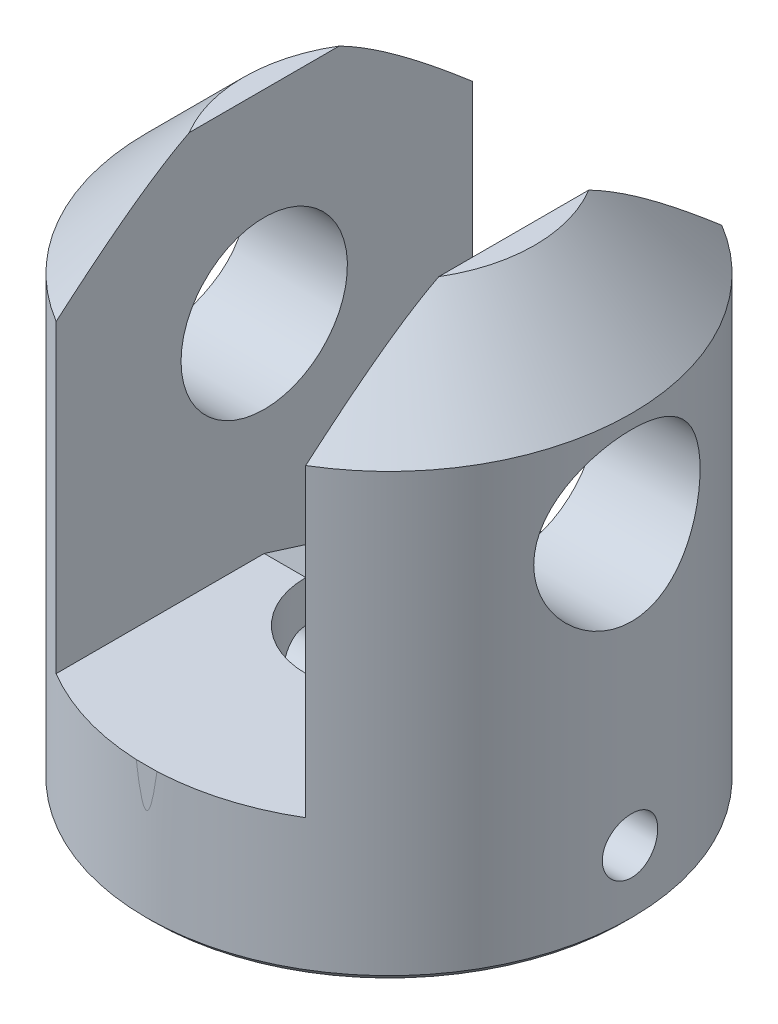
ISO-10303-21;
HEADER;
FILE_DESCRIPTION(('STEP AP214'),'2;1');
FILE_NAME('part.step','',(''),(''),'','','');
FILE_SCHEMA(('AUTOMOTIVE_DESIGN { 1 0 10303 214 1 1 1 1 }'));
ENDSEC;
DATA;
#1=APPLICATION_CONTEXT('core data for automotive mechanical design processes');
#2=APPLICATION_PROTOCOL_DEFINITION('international standard','automotive_design',2000,#1);
#3=PRODUCT_CONTEXT('',#1,'mechanical');
#4=PRODUCT('Part','Part','',(#3));
#5=PRODUCT_RELATED_PRODUCT_CATEGORY('part','',(#4));
#6=PRODUCT_DEFINITION_FORMATION('','',#4);
#7=PRODUCT_DEFINITION_CONTEXT('part definition',#1,'design');
#8=PRODUCT_DEFINITION('design','',#6,#7);
#9=PRODUCT_DEFINITION_SHAPE('','',#8);
#10=(LENGTH_UNIT() NAMED_UNIT(*) SI_UNIT(.MILLI.,.METRE.));
#11=(NAMED_UNIT(*) PLANE_ANGLE_UNIT() SI_UNIT($,.RADIAN.));
#12=(NAMED_UNIT(*) SI_UNIT($,.STERADIAN.) SOLID_ANGLE_UNIT());
#13=UNCERTAINTY_MEASURE_WITH_UNIT(LENGTH_MEASURE(1.E-05),#10,'distance_accuracy_value','');
#14=(GEOMETRIC_REPRESENTATION_CONTEXT(3) GLOBAL_UNCERTAINTY_ASSIGNED_CONTEXT((#13)) GLOBAL_UNIT_ASSIGNED_CONTEXT((#10,
#11,#12)) REPRESENTATION_CONTEXT('',''));
#15=CARTESIAN_POINT('',(0.,0.,0.));
#16=DIRECTION('',(0.,0.,1.));
#17=DIRECTION('',(1.,0.,0.));
#18=AXIS2_PLACEMENT_3D('',#15,#16,#17);
#19=CARTESIAN_POINT('',(-17.5,5.,0.));
#20=DIRECTION('',(1.,0.,0.));
#21=DIRECTION('',(0.,0.,-1.));
#22=AXIS2_PLACEMENT_3D('',#19,#20,#21);
#23=CYLINDRICAL_SURFACE('',#22,2.);
#24=CARTESIAN_POINT('',(-5.65685424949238,5.,-2.));
#25=CARTESIAN_POINT('',(-5.65685389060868,5.10893634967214,-2.00000051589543));
#26=CARTESIAN_POINT('',(-5.66003538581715,5.21786959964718,-1.99106956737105));
#27=CARTESIAN_POINT('',(-5.6723514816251,5.4325088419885,-1.95570226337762));
#28=CARTESIAN_POINT('',(-5.68148706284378,5.53821429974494,-1.9292630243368));
#29=CARTESIAN_POINT('',(-5.70456407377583,5.74325378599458,-1.85991097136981));
#30=CARTESIAN_POINT('',(-5.71849607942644,5.84259985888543,-1.81703044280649));
#31=CARTESIAN_POINT('',(-5.74958244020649,6.03272009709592,-1.71612325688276));
#32=CARTESIAN_POINT('',(-5.76673750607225,6.12349236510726,-1.65809325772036));
#33=CARTESIAN_POINT('',(-5.80308978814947,6.29743992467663,-1.52610229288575));
#34=CARTESIAN_POINT('',(-5.82233789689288,6.38023085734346,-1.45164868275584));
#35=CARTESIAN_POINT('',(-5.86027729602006,6.53241360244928,-1.28997533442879));
#36=CARTESIAN_POINT('',(-5.87896849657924,6.60180326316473,-1.20275355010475));
#37=CARTESIAN_POINT('',(-5.91427733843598,6.72695779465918,-1.01520901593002));
#38=CARTESIAN_POINT('',(-5.93082815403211,6.78231994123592,-0.914603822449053));
#39=CARTESIAN_POINT('',(-5.95939173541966,6.87518317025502,-0.704862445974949));
#40=CARTESIAN_POINT('',(-5.97140572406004,6.91268906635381,-0.595728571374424));
#41=CARTESIAN_POINT('',(-5.98918150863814,6.96747170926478,-0.376057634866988));
#42=CARTESIAN_POINT('',(-5.99514629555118,6.98540689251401,-0.265701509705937));
#43=CARTESIAN_POINT('',(-6.00087216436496,7.00263258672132,-0.0433957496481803));
#44=CARTESIAN_POINT('',(-6.00063484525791,7.00192790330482,0.0685534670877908));
#45=CARTESIAN_POINT('',(-5.99412079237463,6.98231149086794,0.286207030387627));
#46=CARTESIAN_POINT('',(-5.98808129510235,6.96411494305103,0.391984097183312));
#47=CARTESIAN_POINT('',(-5.97093934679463,6.91121403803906,0.598886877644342));
#48=CARTESIAN_POINT('',(-5.95983655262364,6.87650856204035,0.70001227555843));
#49=CARTESIAN_POINT('',(-5.93351340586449,6.79115736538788,0.896304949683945));
#50=CARTESIAN_POINT('',(-5.91824085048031,6.74030812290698,0.991376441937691));
#51=CARTESIAN_POINT('',(-5.88516786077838,6.62428058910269,1.17184865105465));
#52=CARTESIAN_POINT('',(-5.86736672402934,6.55909831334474,1.25724666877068));
#53=CARTESIAN_POINT('',(-5.83012383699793,6.4126512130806,1.42020173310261));
#54=CARTESIAN_POINT('',(-5.81064430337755,6.33077368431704,1.49720031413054));
#55=CARTESIAN_POINT('',(-5.77294670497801,6.15510254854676,1.63655451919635));
#56=CARTESIAN_POINT('',(-5.75472883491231,6.06130710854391,1.69890788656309));
#57=CARTESIAN_POINT('',(-5.72141050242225,5.86269274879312,1.80797491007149));
#58=CARTESIAN_POINT('',(-5.70635818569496,5.75773573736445,1.85445292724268));
#59=CARTESIAN_POINT('',(-5.6816330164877,5.54085721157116,1.92888638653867));
#60=CARTESIAN_POINT('',(-5.67195790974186,5.42893863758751,1.95684959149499));
#61=CARTESIAN_POINT('',(-5.6595927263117,5.20672328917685,1.99232256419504));
#62=CARTESIAN_POINT('',(-5.65660720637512,5.09658115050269,2.00069819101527));
#63=CARTESIAN_POINT('',(-5.65713344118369,4.87644770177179,1.99921087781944));
#64=CARTESIAN_POINT('',(-5.66064401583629,4.76645636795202,1.98935125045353));
#65=CARTESIAN_POINT('',(-5.67347236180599,4.55368606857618,1.95245130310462));
#66=CARTESIAN_POINT('',(-5.68258650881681,4.45078913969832,1.92601278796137));
#67=CARTESIAN_POINT('',(-5.70537107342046,4.25091278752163,1.85742772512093));
#68=CARTESIAN_POINT('',(-5.71904229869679,4.15393441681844,1.81527839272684));
#69=CARTESIAN_POINT('',(-5.74993755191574,3.965239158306,1.71494868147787));
#70=CARTESIAN_POINT('',(-5.76726051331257,3.87378671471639,1.65630223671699));
#71=CARTESIAN_POINT('',(-5.80331537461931,3.70170789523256,1.52517126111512));
#72=CARTESIAN_POINT('',(-5.82204768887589,3.62108472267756,1.45268265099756));
#73=CARTESIAN_POINT('',(-5.85990077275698,3.46894403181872,1.29178341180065));
#74=CARTESIAN_POINT('',(-5.87899687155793,3.3980512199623,1.2027745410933));
#75=CARTESIAN_POINT('',(-5.91453703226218,3.27216771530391,1.01365458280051));
#76=CARTESIAN_POINT('',(-5.9309811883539,3.21717645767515,0.913543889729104));
#77=CARTESIAN_POINT('',(-5.95928811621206,3.12515979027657,0.70555972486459));
#78=CARTESIAN_POINT('',(-5.97118060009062,3.08801744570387,0.597742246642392));
#79=CARTESIAN_POINT('',(-5.98917221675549,3.03254451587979,0.376916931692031));
#80=CARTESIAN_POINT('',(-5.99527344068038,3.01420714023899,0.263910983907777));
#81=CARTESIAN_POINT('',(-6.00083726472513,2.99747584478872,0.0416306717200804));
#82=CARTESIAN_POINT('',(-6.00059840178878,2.99818509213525,-0.0675694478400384));
#83=CARTESIAN_POINT('',(-5.99424393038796,3.01731461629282,-0.284222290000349));
#84=CARTESIAN_POINT('',(-5.98812879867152,3.03573345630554,-0.391675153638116));
#85=CARTESIAN_POINT('',(-5.97081829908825,3.08916446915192,-0.600084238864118));
#86=CARTESIAN_POINT('',(-5.95970516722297,3.12390843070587,-0.701116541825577));
#87=CARTESIAN_POINT('',(-5.9335432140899,3.20875506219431,-0.895956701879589));
#88=CARTESIAN_POINT('',(-5.91849368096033,3.25886051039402,-0.989763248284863));
#89=CARTESIAN_POINT('',(-5.88531737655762,3.37513902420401,-1.17126803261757));
#90=CARTESIAN_POINT('',(-5.86709744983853,3.44183737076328,-1.25861250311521));
#91=CARTESIAN_POINT('',(-5.82985977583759,3.58851478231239,-1.42116205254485));
#92=CARTESIAN_POINT('',(-5.81084177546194,3.66849808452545,-1.49636324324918));
#93=CARTESIAN_POINT('',(-5.77326559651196,3.8432187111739,-1.63548361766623));
#94=CARTESIAN_POINT('',(-5.75475455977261,3.93841102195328,-1.6988459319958));
#95=CARTESIAN_POINT('',(-5.72120386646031,4.13866885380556,-1.80862868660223));
#96=CARTESIAN_POINT('',(-5.70616330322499,4.24373178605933,-1.85505355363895));
#97=CARTESIAN_POINT('',(-5.68202668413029,4.45592364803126,-1.92768765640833));
#98=CARTESIAN_POINT('',(-5.67269265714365,4.56274452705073,-1.95471581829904));
#99=CARTESIAN_POINT('',(-5.66010767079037,4.7797121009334,-1.99086864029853));
#100=CARTESIAN_POINT('',(-5.65685461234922,4.88985763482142,-1.99999947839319));
#101=CARTESIAN_POINT('',(-5.65685424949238,5.,-2.));
#102=B_SPLINE_CURVE_WITH_KNOTS('',3,(#24,#25,#26,#27,#28,#29,#30,#31,#32,#33,#34,#35,#36,#37,
#38,#39,#40,#41,#42,#43,#44,#45,#46,#47,#48,#49,#50,#51,#52,#53,#54,#55,#56,#57,#58,#59,#60,#61,
#62,#63,#64,#65,#66,#67,#68,#69,#70,#71,#72,#73,#74,#75,#76,#77,#78,#79,#80,#81,#82,#83,#84,#85,
#86,#87,#88,#89,#90,#91,#92,#93,#94,#95,#96,#97,#98,#99,#100,#101),.UNSPECIFIED.,.T.,.F.,(4,2,2,
2,2,2,2,2,2,2,2,2,2,2,2,2,2,2,2,2,2,2,2,2,2,2,2,2,2,2,2,2,2,2,2,2,2,2,4),(0.,0.326401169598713,
0.65285611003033,0.97867325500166,1.30456233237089,1.64202674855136,1.97954530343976,
2.32587012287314,2.67210152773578,3.00628637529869,3.34038506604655,3.66138009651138,
3.98239688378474,4.3076330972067,4.63295983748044,4.97360348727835,5.31429959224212,
5.65985279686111,6.00526102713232,6.33508582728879,6.66485071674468,6.98328791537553,
7.30178158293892,7.6303771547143,7.95906971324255,8.30357616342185,8.64807037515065,
8.99027582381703,9.33235766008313,9.65836169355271,9.98433928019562,10.3051391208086,
10.6259970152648,10.9587103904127,11.2915300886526,11.6373780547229,11.9831355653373,
12.3132642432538,12.6432789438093),.UNSPECIFIED.);
#103=CARTESIAN_POINT('',(-5.65685424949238,5.,-2.));
#104=VERTEX_POINT('',#103);
#105=EDGE_CURVE('E177',#104,#104,#102,.T.);
#106=ORIENTED_EDGE('',*,*,#105,.T.);
#107=EDGE_LOOP('',(#106));
#108=FACE_BOUND('',#107,.T.);
#109=CARTESIAN_POINT('',(-17.5,3.,0.));
#110=CARTESIAN_POINT('',(-17.4999985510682,3.00000480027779,-0.111949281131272));
#111=CARTESIAN_POINT('',(-17.4989143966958,3.0094311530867,-0.223970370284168));
#112=CARTESIAN_POINT('',(-17.4946937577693,3.04688888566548,-0.444900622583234));
#113=CARTESIAN_POINT('',(-17.4915550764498,3.07494018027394,-0.553806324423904));
#114=CARTESIAN_POINT('',(-17.4835792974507,3.14881506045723,-0.765274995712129));
#115=CARTESIAN_POINT('',(-17.4787432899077,3.19462724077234,-0.867841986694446));
#116=CARTESIAN_POINT('',(-17.4679120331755,3.30269974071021,-1.06381060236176));
#117=CARTESIAN_POINT('',(-17.4619169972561,3.36495703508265,-1.15721390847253));
#118=CARTESIAN_POINT('',(-17.4494069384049,3.50446172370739,-1.33265783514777));
#119=CARTESIAN_POINT('',(-17.4428898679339,3.58177003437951,-1.41464987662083));
#120=CARTESIAN_POINT('',(-17.4300869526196,3.74905175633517,-1.56452579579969));
#121=CARTESIAN_POINT('',(-17.4238011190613,3.83902578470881,-1.63240898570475));
#122=CARTESIAN_POINT('',(-17.4121519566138,4.02939576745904,-1.75231750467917));
#123=CARTESIAN_POINT('',(-17.4067912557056,4.12982015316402,-1.80429797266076));
#124=CARTESIAN_POINT('',(-17.3976257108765,4.33804396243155,-1.89063905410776));
#125=CARTESIAN_POINT('',(-17.3938208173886,4.44584315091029,-1.92500022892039));
#126=CARTESIAN_POINT('',(-17.3882168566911,4.66525581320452,-1.97498120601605));
#127=CARTESIAN_POINT('',(-17.3864090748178,4.77685050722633,-1.99068245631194));
#128=CARTESIAN_POINT('',(-17.3849772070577,5.00110459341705,-2.00314979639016));
#129=CARTESIAN_POINT('',(-17.3853530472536,5.1137639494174,-1.99991652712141));
#130=CARTESIAN_POINT('',(-17.3882379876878,5.33638457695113,-1.9746735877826));
#131=CARTESIAN_POINT('',(-17.3907369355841,5.44635613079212,-1.95275327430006));
#132=CARTESIAN_POINT('',(-17.3975706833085,5.6610493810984,-1.89089772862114));
#133=CARTESIAN_POINT('',(-17.4019055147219,5.76577098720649,-1.85096218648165));
#134=CARTESIAN_POINT('',(-17.4119342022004,5.96727140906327,-1.75411258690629));
#135=CARTESIAN_POINT('',(-17.4176311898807,6.06403122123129,-1.697159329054));
#136=CARTESIAN_POINT('',(-17.4297397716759,6.24665329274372,-1.5679190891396));
#137=CARTESIAN_POINT('',(-17.4361513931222,6.33251513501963,-1.49563152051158));
#138=CARTESIAN_POINT('',(-17.4490120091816,6.49142289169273,-1.33727766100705));
#139=CARTESIAN_POINT('',(-17.455461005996,6.56439200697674,-1.25113428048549));
#140=CARTESIAN_POINT('',(-17.4676349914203,6.69484625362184,-1.06778054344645));
#141=CARTESIAN_POINT('',(-17.4733599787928,6.75233135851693,-0.970570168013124));
#142=CARTESIAN_POINT('',(-17.4834436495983,6.85018441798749,-0.767785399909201));
#143=CARTESIAN_POINT('',(-17.487801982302,6.89054797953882,-0.662208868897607));
#144=CARTESIAN_POINT('',(-17.4946579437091,6.95295335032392,-0.445716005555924));
#145=CARTESIAN_POINT('',(-17.4971556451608,6.97499587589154,-0.33479988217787));
#146=CARTESIAN_POINT('',(-17.4999995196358,7.00003489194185,-0.111440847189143));
#147=CARTESIAN_POINT('',(-17.5003576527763,7.00313725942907,0.000990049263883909));
#148=CARTESIAN_POINT('',(-17.4989142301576,6.99048670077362,0.224770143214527));
#149=CARTESIAN_POINT('',(-17.4971127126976,6.97473410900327,0.336119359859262));
#150=CARTESIAN_POINT('',(-17.4915599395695,6.9249086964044,0.554265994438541));
#151=CARTESIAN_POINT('',(-17.4878140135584,6.89088594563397,0.661074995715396));
#152=CARTESIAN_POINT('',(-17.4787921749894,6.80553777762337,0.867470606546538));
#153=CARTESIAN_POINT('',(-17.4735162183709,6.75421186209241,0.967057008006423));
#154=CARTESIAN_POINT('',(-17.4619935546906,6.63545523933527,1.1566560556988));
#155=CARTESIAN_POINT('',(-17.4557427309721,6.56795555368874,1.24662524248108));
#156=CARTESIAN_POINT('',(-17.4429836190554,6.41886564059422,1.41399482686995));
#157=CARTESIAN_POINT('',(-17.4364753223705,6.33727494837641,1.49139480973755));
#158=CARTESIAN_POINT('',(-17.4238982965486,6.16185467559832,1.63180089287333));
#159=CARTESIAN_POINT('',(-17.4178317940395,6.06796898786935,1.69473712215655));
#160=CARTESIAN_POINT('',(-17.4068606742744,5.87089807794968,1.80394755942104));
#161=CARTESIAN_POINT('',(-17.4019560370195,5.76771301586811,1.85022205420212));
#162=CARTESIAN_POINT('',(-17.3938786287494,5.55520428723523,1.92468057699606));
#163=CARTESIAN_POINT('',(-17.3907019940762,5.44589492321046,1.9529049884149));
#164=CARTESIAN_POINT('',(-17.3864287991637,5.22404998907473,1.99059267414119));
#165=CARTESIAN_POINT('',(-17.385332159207,5.11151454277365,2.00005666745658));
#166=CARTESIAN_POINT('',(-17.385345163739,4.88710669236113,1.99994314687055));
#167=CARTESIAN_POINT('',(-17.3864420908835,4.77523421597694,1.99047539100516));
#168=CARTESIAN_POINT('',(-17.3906913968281,4.55468101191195,1.95299850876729));
#169=CARTESIAN_POINT('',(-17.3938437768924,4.44600028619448,1.92498937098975));
#170=CARTESIAN_POINT('',(-17.4018450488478,4.23492395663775,1.85125733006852));
#171=CARTESIAN_POINT('',(-17.4066935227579,4.13252681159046,1.80553879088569));
#172=CARTESIAN_POINT('',(-17.4175414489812,3.93684081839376,1.69769666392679));
#173=CARTESIAN_POINT('',(-17.4235409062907,3.84355200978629,1.63557300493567));
#174=CARTESIAN_POINT('',(-17.4360565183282,3.66816886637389,1.496274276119));
#175=CARTESIAN_POINT('',(-17.4425753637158,3.58613974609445,1.41901733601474));
#176=CARTESIAN_POINT('',(-17.4553710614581,3.43616572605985,1.25181311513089));
#177=CARTESIAN_POINT('',(-17.4616478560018,3.36822417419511,1.16186282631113));
#178=CARTESIAN_POINT('',(-17.4732739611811,3.24817382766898,0.971500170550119));
#179=CARTESIAN_POINT('',(-17.478620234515,3.19611647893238,0.87105519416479));
#180=CARTESIAN_POINT('',(-17.4877513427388,3.1096797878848,0.662847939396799));
#181=CARTESIAN_POINT('',(-17.4915379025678,3.07528090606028,0.555093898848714));
#182=CARTESIAN_POINT('',(-17.4961924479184,3.03352889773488,0.372298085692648));
#183=CARTESIAN_POINT('',(-17.4976134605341,3.02097322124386,0.298416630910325));
#184=CARTESIAN_POINT('',(-17.499517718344,3.00420719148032,0.149700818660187));
#185=CARTESIAN_POINT('',(-17.5000009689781,2.99999678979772,0.0748664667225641));
#186=CARTESIAN_POINT('',(-17.5,3.,0.));
#187=B_SPLINE_CURVE_WITH_KNOTS('',3,(#109,#110,#111,#112,#113,#114,#115,#116,#117,#118,#119,
#120,#121,#122,#123,#124,#125,#126,#127,#128,#129,#130,#131,#132,#133,#134,#135,#136,#137,#138,
#139,#140,#141,#142,#143,#144,#145,#146,#147,#148,#149,#150,#151,#152,#153,#154,#155,#156,#157,
#158,#159,#160,#161,#162,#163,#164,#165,#166,#167,#168,#169,#170,#171,#172,#173,#174,#175,#176,
#177,#178,#179,#180,#181,#182,#183,#184,#185,#186),.UNSPECIFIED.,.T.,.F.,(4,2,2,2,2,2,2,2,2,2,2,
2,2,2,2,2,2,2,2,2,2,2,2,2,2,2,2,2,2,2,2,2,2,2,2,2,2,2,4),(0.,0.33557441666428,0.671508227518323,
1.00722667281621,1.34288340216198,1.67992799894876,2.01698902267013,2.3549922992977,
2.69298480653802,3.02949654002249,3.36599688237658,3.70089713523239,4.03580315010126,
4.3714866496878,4.7071829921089,5.04481612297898,5.38244983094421,5.72017011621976,
6.05787719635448,6.39369472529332,6.72950629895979,7.06440223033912,7.3993078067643,
7.73566795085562,8.07203919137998,8.41000271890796,8.74796042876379,9.08515935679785,
9.42234536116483,9.75758217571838,10.0928191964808,10.4279736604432,10.763129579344,
11.100151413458,11.4372532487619,11.7754355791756,12.1132428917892,12.3376607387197,
12.5620772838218),.UNSPECIFIED.);
#188=CARTESIAN_POINT('',(-17.5,3.,0.));
#189=VERTEX_POINT('',#188);
#190=EDGE_CURVE('E153',#189,#189,#187,.T.);
#191=ORIENTED_EDGE('',*,*,#190,.F.);
#192=EDGE_LOOP('',(#191));
#193=FACE_BOUND('',#192,.T.);
#194=ADVANCED_FACE('F30',(#108,#193),#23,.F.);
#195=CARTESIAN_POINT('',(0.,39.,0.));
#196=DIRECTION('',(0.,1.,0.));
#197=DIRECTION('',(0.,0.,1.));
#198=AXIS2_PLACEMENT_3D('',#195,#196,#197);
#199=PLANE('',#198);
#200=CARTESIAN_POINT('',(0.,39.,0.));
#201=DIRECTION('',(0.,1.,0.));
#202=DIRECTION('',(0.,0.,1.));
#203=AXIS2_PLACEMENT_3D('',#200,#201,#202);
#204=CIRCLE('',#203,10.5);
#205=CARTESIAN_POINT('',(9.,39.,5.40832691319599));
#206=VERTEX_POINT('',#205);
#207=CARTESIAN_POINT('',(9.,39.,-5.40832691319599));
#208=VERTEX_POINT('',#207);
#209=EDGE_CURVE('E142',#206,#208,#204,.T.);
#210=ORIENTED_EDGE('',*,*,#209,.T.);
#211=DIRECTION('',(0.,0.,1.));
#212=VECTOR('',#211,1.);
#213=CARTESIAN_POINT('',(9.,39.,-10.5));
#214=LINE('',#213,#212);
#215=EDGE_CURVE('E212',#208,#206,#214,.T.);
#216=ORIENTED_EDGE('',*,*,#215,.T.);
#217=EDGE_LOOP('',(#210,#216));
#218=FACE_BOUND('',#217,.T.);
#219=ADVANCED_FACE('F235',(#218),#199,.T.);
#220=CARTESIAN_POINT('',(0.,39.,0.));
#221=DIRECTION('',(0.,-1.,0.));
#222=DIRECTION('',(0.,0.,-1.));
#223=AXIS2_PLACEMENT_3D('',#220,#221,#222);
#224=CONICAL_SURFACE('',#223,10.5,0.785398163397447);
#225=CARTESIAN_POINT('',(0.,32.,0.));
#226=DIRECTION('',(0.,1.,0.));
#227=DIRECTION('',(0.,0.,1.));
#228=AXIS2_PLACEMENT_3D('',#225,#226,#227);
#229=CIRCLE('',#228,17.5);
#230=CARTESIAN_POINT('',(9.,32.,-15.0083310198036));
#231=VERTEX_POINT('',#230);
#232=CARTESIAN_POINT('',(9.,32.,15.0083310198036));
#233=VERTEX_POINT('',#232);
#234=EDGE_CURVE('E143',#231,#233,#229,.F.);
#235=ORIENTED_EDGE('',*,*,#234,.F.);
#236=CARTESIAN_POINT('',(9.,10.5839180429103,-37.8610807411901));
#237=CARTESIAN_POINT('',(9.,11.0490036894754,-37.3830333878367));
#238=CARTESIAN_POINT('',(9.,11.5138495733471,-36.9047528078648));
#239=CARTESIAN_POINT('',(9.,12.4429984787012,-35.9476641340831));
#240=CARTESIAN_POINT('',(9.,12.9073014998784,-35.4688560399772));
#241=CARTESIAN_POINT('',(9.,14.2993255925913,-34.0315237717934));
#242=CARTESIAN_POINT('',(9.,15.2261365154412,-33.0721174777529));
#243=CARTESIAN_POINT('',(9.,17.0781780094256,-31.148708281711));
#244=CARTESIAN_POINT('',(9.,18.0034034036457,-30.1847003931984));
#245=CARTESIAN_POINT('',(9.,19.8497331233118,-28.2527782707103));
#246=CARTESIAN_POINT('',(9.,20.7708375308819,-27.2848641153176));
#247=CARTESIAN_POINT('',(9.,22.1792822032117,-25.796308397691));
#248=CARTESIAN_POINT('',(9.,22.6686152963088,-25.2775524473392));
#249=CARTESIAN_POINT('',(9.,23.6453800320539,-24.2382540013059));
#250=CARTESIAN_POINT('',(9.,24.1328116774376,-23.7177115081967));
#251=CARTESIAN_POINT('',(9.,25.1054215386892,-22.6744584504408));
#252=CARTESIAN_POINT('',(9.,25.5905995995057,-22.1517477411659));
#253=CARTESIAN_POINT('',(9.,26.5581657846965,-21.1037511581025));
#254=CARTESIAN_POINT('',(9.,27.0405539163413,-20.5784652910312));
#255=CARTESIAN_POINT('',(9.,28.0013757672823,-19.5252994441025));
#256=CARTESIAN_POINT('',(9.,28.479813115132,-18.9974227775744));
#257=CARTESIAN_POINT('',(9.,29.4323619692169,-17.9377820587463));
#258=CARTESIAN_POINT('',(9.,29.9064735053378,-17.4060180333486));
#259=CARTESIAN_POINT('',(9.,30.8491083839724,-16.3376556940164));
#260=CARTESIAN_POINT('',(9.,31.3176323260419,-15.8010579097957));
#261=CARTESIAN_POINT('',(9.,32.2474343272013,-14.721630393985));
#262=CARTESIAN_POINT('',(9.,32.7087126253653,-14.178800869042));
#263=CARTESIAN_POINT('',(9.,33.462276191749,-13.2758018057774));
#264=CARTESIAN_POINT('',(9.,33.7573725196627,-12.9179797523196));
#265=CARTESIAN_POINT('',(9.,34.3424575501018,-12.1981605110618));
#266=CARTESIAN_POINT('',(9.,34.6324461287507,-11.8361632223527));
#267=CARTESIAN_POINT('',(9.,35.206456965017,-11.1065823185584));
#268=CARTESIAN_POINT('',(9.,35.4904696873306,-10.7389911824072));
#269=CARTESIAN_POINT('',(9.,36.0503240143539,-9.99764332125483));
#270=CARTESIAN_POINT('',(9.,36.3261660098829,-9.62388689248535));
#271=CARTESIAN_POINT('',(9.,36.8647806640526,-8.87225428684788));
#272=CARTESIAN_POINT('',(9.,37.1276505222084,-8.49444807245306));
#273=CARTESIAN_POINT('',(9.,37.6397857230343,-7.72952019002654));
#274=CARTESIAN_POINT('',(9.,37.8890476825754,-7.34239623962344));
#275=CARTESIAN_POINT('',(9.,38.3686389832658,-6.55770505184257));
#276=CARTESIAN_POINT('',(9.00000000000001,38.5990094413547,-6.16016312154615));
#277=CARTESIAN_POINT('',(9.,39.034640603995,-5.35160956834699));
#278=CARTESIAN_POINT('',(9.,39.2399181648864,-4.9406072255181));
#279=CARTESIAN_POINT('',(9.,39.5024764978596,-4.35573082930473));
#280=CARTESIAN_POINT('',(9.,39.5743330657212,-4.1883787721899));
#281=CARTESIAN_POINT('',(9.,39.7118580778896,-3.85116472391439));
#282=CARTESIAN_POINT('',(9.,39.7775265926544,-3.68130276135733));
#283=CARTESIAN_POINT('',(9.,39.9640918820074,-3.16782432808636));
#284=CARTESIAN_POINT('',(9.,40.0745743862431,-2.82025865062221));
#285=CARTESIAN_POINT('',(9.,40.2138221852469,-2.29377950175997));
#286=CARTESIAN_POINT('',(9.,40.2556899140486,-2.11826712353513));
#287=CARTESIAN_POINT('',(9.,40.3301295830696,-1.76529356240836));
#288=CARTESIAN_POINT('',(9.,40.3627033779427,-1.58783277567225));
#289=CARTESIAN_POINT('',(9.,40.417853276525,-1.23140752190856));
#290=CARTESIAN_POINT('',(9.,40.4404323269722,-1.05244351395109));
#291=CARTESIAN_POINT('',(9.,40.4750882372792,-0.69352225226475));
#292=CARTESIAN_POINT('',(9.,40.4871658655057,-0.513565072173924));
#293=CARTESIAN_POINT('',(9.,40.5046938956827,-0.0394672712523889));
#294=CARTESIAN_POINT('',(9.,40.5011510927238,0.255057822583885));
#295=CARTESIAN_POINT('',(9.,40.4654311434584,0.842282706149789));
#296=CARTESIAN_POINT('',(9.,40.4332550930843,1.13498256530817));
#297=CARTESIAN_POINT('',(9.,40.3420874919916,1.71776014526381));
#298=CARTESIAN_POINT('',(9.00000000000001,40.2829495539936,2.00781461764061));
#299=CARTESIAN_POINT('',(9.,40.1410752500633,2.58204970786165));
#300=CARTESIAN_POINT('',(9.,40.0583350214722,2.86622935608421));
#301=CARTESIAN_POINT('',(9.,39.8736189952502,3.42585938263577));
#302=CARTESIAN_POINT('',(9.,39.7717895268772,3.7013586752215));
#303=CARTESIAN_POINT('',(9.00000000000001,39.5518775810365,4.24584687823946));
#304=CARTESIAN_POINT('',(9.,39.4337890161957,4.51483330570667));
#305=CARTESIAN_POINT('',(9.,39.1841796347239,5.04692396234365));
#306=CARTESIAN_POINT('',(9.,39.0526396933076,5.31001914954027));
#307=CARTESIAN_POINT('',(9.,38.7787503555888,5.83044974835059));
#308=CARTESIAN_POINT('',(9.,38.6364021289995,6.08778577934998));
#309=CARTESIAN_POINT('',(9.,38.3418810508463,6.59905833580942));
#310=CARTESIAN_POINT('',(9.,38.1896485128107,6.85296031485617));
#311=CARTESIAN_POINT('',(9.,37.8778360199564,7.35620101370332));
#312=CARTESIAN_POINT('',(9.,37.718255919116,7.6055396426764));
#313=CARTESIAN_POINT('',(9.,37.3931751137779,8.09999210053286));
#314=CARTESIAN_POINT('',(9.,37.2276798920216,8.34510954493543));
#315=CARTESIAN_POINT('',(9.,36.891650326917,8.83184387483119));
#316=CARTESIAN_POINT('',(9.,36.7211161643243,9.07346088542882));
#317=CARTESIAN_POINT('',(9.,36.3613532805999,9.57375305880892));
#318=CARTESIAN_POINT('',(9.,36.1717550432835,9.8321620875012));
#319=CARTESIAN_POINT('',(9.,35.7883975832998,10.3458790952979));
#320=CARTESIAN_POINT('',(9.,35.5946382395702,10.6011869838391));
#321=CARTESIAN_POINT('',(9.,35.0080868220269,11.3631457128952));
#322=CARTESIAN_POINT('',(9.,34.6100649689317,11.8657716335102));
#323=CARTESIAN_POINT('',(9.,33.8037227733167,12.8630855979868));
#324=CARTESIAN_POINT('',(9.,33.3953970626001,13.3577692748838));
#325=CARTESIAN_POINT('',(9.,32.5711823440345,14.3407302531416));
#326=CARTESIAN_POINT('',(9.,32.1552938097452,14.8290079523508));
#327=CARTESIAN_POINT('',(9.,31.3169523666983,15.801390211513));
#328=CARTESIAN_POINT('',(9.,30.8944891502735,16.2854858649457));
#329=CARTESIAN_POINT('',(9.,30.0449724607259,17.249638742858));
#330=CARTESIAN_POINT('',(9.,29.6179189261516,17.7296959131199));
#331=CARTESIAN_POINT('',(9.,28.7602822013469,18.6863794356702));
#332=CARTESIAN_POINT('',(9.,28.3297001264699,19.1630067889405));
#333=CARTESIAN_POINT('',(9.,27.4655664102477,20.1135637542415));
#334=CARTESIAN_POINT('',(9.,27.0320147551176,20.5874933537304));
#335=CARTESIAN_POINT('',(9.,26.1636195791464,21.53185984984));
#336=CARTESIAN_POINT('',(9.,25.7287824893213,22.002302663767));
#337=CARTESIAN_POINT('',(9.,24.8570841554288,22.9413098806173));
#338=CARTESIAN_POINT('',(9.,24.4202229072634,23.409874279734));
#339=CARTESIAN_POINT('',(9.,23.107040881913,24.8132556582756));
#340=CARTESIAN_POINT('',(9.,22.2281809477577,25.7456967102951));
#341=CARTESIAN_POINT('',(9.,20.4662893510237,27.605148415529));
#342=CARTESIAN_POINT('',(9.,19.5832617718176,28.5321629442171));
#343=CARTESIAN_POINT('',(9.,17.8135169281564,30.3826643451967));
#344=CARTESIAN_POINT('',(9.,16.926799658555,31.3061512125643));
#345=CARTESIAN_POINT('',(9.,15.5853997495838,32.6988687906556));
#346=CARTESIAN_POINT('',(9.,15.1317684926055,33.169113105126));
#347=CARTESIAN_POINT('',(9.,14.2237891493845,34.1090286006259));
#348=CARTESIAN_POINT('',(9.,13.7694409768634,34.5786996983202));
#349=CARTESIAN_POINT('',(9.,12.8601651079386,35.5174764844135));
#350=CARTESIAN_POINT('',(9.,12.4052374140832,35.9865821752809));
#351=CARTESIAN_POINT('',(9.,11.4949222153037,36.9242265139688));
#352=CARTESIAN_POINT('',(9.,11.0395347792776,37.392765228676));
#353=CARTESIAN_POINT('',(9.,10.5839180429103,37.8610807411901));
#354=B_SPLINE_CURVE_WITH_KNOTS('',3,(#236,#237,#238,#239,#240,#241,#242,#243,#244,#245,#246,
#247,#248,#249,#250,#251,#252,#253,#254,#255,#256,#257,#258,#259,#260,#261,#262,#263,#264,#265,
#266,#267,#268,#269,#270,#271,#272,#273,#274,#275,#276,#277,#278,#279,#280,#281,#282,#283,#284,
#285,#286,#287,#288,#289,#290,#291,#292,#293,#294,#295,#296,#297,#298,#299,#300,#301,#302,#303,
#304,#305,#306,#307,#308,#309,#310,#311,#312,#313,#314,#315,#316,#317,#318,#319,#320,#321,#322,
#323,#324,#325,#326,#327,#328,#329,#330,#331,#332,#333,#334,#335,#336,#337,#338,#339,#340,#341,
#342,#343,#344,#345,#346,#347,#348,#349,#350,#351,#352,#353),.UNSPECIFIED.,.F.,.F.,(4,2,2,2,2,2,
2,2,2,2,2,2,2,2,2,2,2,2,2,2,2,2,2,2,2,2,2,2,2,2,2,2,2,2,2,2,2,2,2,2,2,2,2,2,2,2,2,2,2,2,2,2,2,2,
2,2,2,2,4),(0.,2.00087596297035,4.00175304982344,8.00361551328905,12.0121207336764,
16.0205457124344,18.1599324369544,20.2993160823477,22.4388448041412,24.578367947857,
26.7156385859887,28.8528944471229,30.9899188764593,33.1268726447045,34.5182622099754,
35.9096854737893,37.303182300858,38.6966123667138,40.0771689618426,41.4580672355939,
42.8358755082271,44.2127530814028,44.7590210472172,45.3052827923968,46.397619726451,
46.9387309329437,47.4797340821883,48.0205776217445,48.5613815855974,49.4434967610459,
50.325578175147,51.2125068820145,52.0995808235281,52.9801140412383,53.8609778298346,
54.7431118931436,55.625150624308,56.5131270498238,57.4011211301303,58.2883124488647,
59.1754719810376,60.1369325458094,61.0984211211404,63.0216206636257,64.9458437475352,
66.8699467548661,68.7974522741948,70.7249836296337,72.6519275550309,74.5788804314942,
76.5007467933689,78.422617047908,82.2666191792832,86.1074202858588,89.9482267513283,
91.9083791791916,93.8687889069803,95.8291900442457,97.7893314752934),.UNSPECIFIED.);
#355=EDGE_CURVE('E230',#231,#208,#354,.T.);
#356=ORIENTED_EDGE('',*,*,#355,.T.);
#357=ORIENTED_EDGE('',*,*,#209,.F.);
#358=EDGE_CURVE('E255',#206,#233,#354,.T.);
#359=ORIENTED_EDGE('',*,*,#358,.T.);
#360=EDGE_LOOP('',(#235,#356,#357,#359));
#361=FACE_BOUND('',#360,.T.);
#362=ADVANCED_FACE('F241',(#361),#224,.T.);
#363=CARTESIAN_POINT('',(0.,39.,0.));
#364=DIRECTION('',(0.,-1.,0.));
#365=DIRECTION('',(0.,0.,-1.));
#366=AXIS2_PLACEMENT_3D('',#363,#364,#365);
#367=CYLINDRICAL_SURFACE('',#366,17.5);
#368=CARTESIAN_POINT('',(0.,0.499999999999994,0.));
#369=DIRECTION('',(0.,1.,0.));
#370=DIRECTION('',(0.,0.,1.));
#371=AXIS2_PLACEMENT_3D('',#368,#369,#370);
#372=CIRCLE('',#371,17.5);
#373=CARTESIAN_POINT('',(0.,0.499999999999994,17.5));
#374=VERTEX_POINT('',#373);
#375=EDGE_CURVE('E39',#374,#374,#372,.T.);
#376=ORIENTED_EDGE('',*,*,#375,.T.);
#377=EDGE_LOOP('',(#376));
#378=FACE_BOUND('',#377,.T.);
#379=CARTESIAN_POINT('',(-17.5,19.,0.));
#380=CARTESIAN_POINT('',(-17.5000001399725,18.999999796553,-0.163389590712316));
#381=CARTESIAN_POINT('',(-17.4977065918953,19.0066793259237,-0.326776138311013));
#382=CARTESIAN_POINT('',(-17.488594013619,19.0333361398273,-0.652391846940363));
#383=CARTESIAN_POINT('',(-17.4817733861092,19.0533181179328,-0.814620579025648));
#384=CARTESIAN_POINT('',(-17.4637940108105,19.1063828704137,-1.13661475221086));
#385=CARTESIAN_POINT('',(-17.452636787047,19.139461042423,-1.29638103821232));
#386=CARTESIAN_POINT('',(-17.4262791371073,19.2184267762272,-1.61243727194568));
#387=CARTESIAN_POINT('',(-17.4110771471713,19.2643192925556,-1.76872584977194));
#388=CARTESIAN_POINT('',(-17.3770708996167,19.3683923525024,-2.07636915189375));
#389=CARTESIAN_POINT('',(-17.3582744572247,19.4265462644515,-2.22773376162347));
#390=CARTESIAN_POINT('',(-17.3175366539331,19.5547479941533,-2.52496271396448));
#391=CARTESIAN_POINT('',(-17.2955941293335,19.624800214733,-2.6708249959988));
#392=CARTESIAN_POINT('',(-17.2491308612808,19.7762364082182,-2.95607249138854));
#393=CARTESIAN_POINT('',(-17.2246106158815,19.8576181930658,-3.09545894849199));
#394=CARTESIAN_POINT('',(-17.1735920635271,20.0311826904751,-3.36702141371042));
#395=CARTESIAN_POINT('',(-17.1470930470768,20.1233692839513,-3.49919480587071));
#396=CARTESIAN_POINT('',(-17.091893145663,20.3210990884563,-3.75971990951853));
#397=CARTESIAN_POINT('',(-17.0631486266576,20.4269799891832,-3.88780616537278));
#398=CARTESIAN_POINT('',(-17.0050134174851,20.6489141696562,-4.13468315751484));
#399=CARTESIAN_POINT('',(-16.9756227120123,20.7649676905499,-4.25347367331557));
#400=CARTESIAN_POINT('',(-16.9169627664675,21.0065846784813,-4.48109269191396));
#401=CARTESIAN_POINT('',(-16.8876935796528,21.1321519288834,-4.58991719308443));
#402=CARTESIAN_POINT('',(-16.8300886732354,21.3919641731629,-4.79683730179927));
#403=CARTESIAN_POINT('',(-16.8017526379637,21.5262061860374,-4.8949365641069));
#404=CARTESIAN_POINT('',(-16.7459300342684,21.8069332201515,-5.08268823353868));
#405=CARTESIAN_POINT('',(-16.7184975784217,21.9536695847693,-5.17198146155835));
#406=CARTESIAN_POINT('',(-16.6662971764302,22.2545672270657,-5.33779870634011));
#407=CARTESIAN_POINT('',(-16.641528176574,22.4087255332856,-5.41432777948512));
#408=CARTESIAN_POINT('',(-16.5954258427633,22.7235118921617,-5.55403069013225));
#409=CARTESIAN_POINT('',(-16.5740930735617,22.8841410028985,-5.61720233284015));
#410=CARTESIAN_POINT('',(-16.5355860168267,23.2106253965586,-5.72956595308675));
#411=CARTESIAN_POINT('',(-16.5184098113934,23.3764782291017,-5.77876437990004));
#412=CARTESIAN_POINT('',(-16.4893150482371,23.706342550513,-5.86125718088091));
#413=CARTESIAN_POINT('',(-16.4772336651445,23.8702156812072,-5.8950474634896));
#414=CARTESIAN_POINT('',(-16.4578908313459,24.2004254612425,-5.94883595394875));
#415=CARTESIAN_POINT('',(-16.4506273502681,24.3667610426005,-5.96883997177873));
#416=CARTESIAN_POINT('',(-16.4411606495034,24.700652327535,-5.9948669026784));
#417=CARTESIAN_POINT('',(-16.4389569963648,24.8682079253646,-6.00089101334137));
#418=CARTESIAN_POINT('',(-16.4396850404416,25.2032216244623,-5.99889639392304));
#419=CARTESIAN_POINT('',(-16.4426165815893,25.3706797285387,-5.99087809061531));
#420=CARTESIAN_POINT('',(-16.4532454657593,25.6959999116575,-5.9616221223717));
#421=CARTESIAN_POINT('',(-16.4607024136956,25.853930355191,-5.94105099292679));
#422=CARTESIAN_POINT('',(-16.4799410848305,26.1674538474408,-5.88747410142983));
#423=CARTESIAN_POINT('',(-16.4917242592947,26.323046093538,-5.85446416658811));
#424=CARTESIAN_POINT('',(-16.5192569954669,26.6307452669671,-5.77631897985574));
#425=CARTESIAN_POINT('',(-16.5350054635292,26.7828531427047,-5.73118707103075));
#426=CARTESIAN_POINT('',(-16.5700183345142,27.082712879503,-5.62915620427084));
#427=CARTESIAN_POINT('',(-16.5892840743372,27.230463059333,-5.57225277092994));
#428=CARTESIAN_POINT('',(-16.6311273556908,27.5230347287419,-5.44610761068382));
#429=CARTESIAN_POINT('',(-16.6537539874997,27.6677685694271,-5.37667900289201));
#430=CARTESIAN_POINT('',(-16.7014549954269,27.9509471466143,-5.22662395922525));
#431=CARTESIAN_POINT('',(-16.726530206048,28.0893897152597,-5.14599370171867));
#432=CARTESIAN_POINT('',(-16.7784524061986,28.3591651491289,-4.97409227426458));
#433=CARTESIAN_POINT('',(-16.8052995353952,28.4904974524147,-4.88282026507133));
#434=CARTESIAN_POINT('',(-16.8600699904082,28.7453235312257,-4.69020928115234));
#435=CARTESIAN_POINT('',(-16.887993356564,28.8688170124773,-4.58886992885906));
#436=CARTESIAN_POINT('',(-16.9457800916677,29.1139311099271,-4.37080702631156));
#437=CARTESIAN_POINT('',(-16.9756649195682,29.235064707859,-4.25354109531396));
#438=CARTESIAN_POINT('',(-17.0350210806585,29.4670478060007,-4.00922102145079));
#439=CARTESIAN_POINT('',(-17.0644925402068,29.5779005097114,-3.88216995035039));
#440=CARTESIAN_POINT('',(-17.1222463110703,29.7886950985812,-3.61895574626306));
#441=CARTESIAN_POINT('',(-17.1505280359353,29.8886316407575,-3.48278820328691));
#442=CARTESIAN_POINT('',(-17.2051079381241,30.0767947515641,-3.20229046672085));
#443=CARTESIAN_POINT('',(-17.2314068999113,30.1650259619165,-3.05796354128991));
#444=CARTESIAN_POINT('',(-17.2816010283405,30.3301022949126,-2.76030824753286));
#445=CARTESIAN_POINT('',(-17.3054650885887,30.4068048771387,-2.606895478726));
#446=CARTESIAN_POINT('',(-17.3497524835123,30.5469207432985,-2.29370601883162));
#447=CARTESIAN_POINT('',(-17.3701771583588,30.6103392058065,-2.13393183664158));
#448=CARTESIAN_POINT('',(-17.4070035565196,30.7233406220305,-1.80912555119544));
#449=CARTESIAN_POINT('',(-17.423405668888,30.7729249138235,-1.64409395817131));
#450=CARTESIAN_POINT('',(-17.4517036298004,30.8577779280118,-1.31001358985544));
#451=CARTESIAN_POINT('',(-17.4635996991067,30.8930473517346,-1.14096501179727));
#452=CARTESIAN_POINT('',(-17.4820974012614,30.9476345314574,-0.807961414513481));
#453=CARTESIAN_POINT('',(-17.4889155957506,30.9676059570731,-0.644125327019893));
#454=CARTESIAN_POINT('',(-17.4979336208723,30.9939833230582,-0.315240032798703));
#455=CARTESIAN_POINT('',(-17.5001336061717,31.0003897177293,-0.150190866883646));
#456=CARTESIAN_POINT('',(-17.4998538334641,30.9995736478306,0.179842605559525));
#457=CARTESIAN_POINT('',(-17.497374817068,30.9923533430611,0.344826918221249));
#458=CARTESIAN_POINT('',(-17.487807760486,30.9643602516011,0.673505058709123));
#459=CARTESIAN_POINT('',(-17.4807197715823,30.9435876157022,0.837198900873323));
#460=CARTESIAN_POINT('',(-17.4624226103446,30.8895523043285,1.15699915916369));
#461=CARTESIAN_POINT('',(-17.4513489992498,30.8566997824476,1.31318291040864));
#462=CARTESIAN_POINT('',(-17.4253423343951,30.7787459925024,1.62218787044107));
#463=CARTESIAN_POINT('',(-17.4104079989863,30.7336406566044,1.7750079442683));
#464=CARTESIAN_POINT('',(-17.3770641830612,30.6315791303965,2.07619695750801));
#465=CARTESIAN_POINT('',(-17.3586556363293,30.5746261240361,2.22456708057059));
#466=CARTESIAN_POINT('',(-17.31881065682,30.4492873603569,2.51603746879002));
#467=CARTESIAN_POINT('',(-17.2973730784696,30.3808972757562,2.65913571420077));
#468=CARTESIAN_POINT('',(-17.2513908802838,30.2312228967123,2.94291064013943));
#469=CARTESIAN_POINT('',(-17.2267785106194,30.1496427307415,3.08342026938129));
#470=CARTESIAN_POINT('',(-17.1755327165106,29.9755248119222,3.35715286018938));
#471=CARTESIAN_POINT('',(-17.1488985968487,29.8829832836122,3.49037328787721));
#472=CARTESIAN_POINT('',(-17.0942813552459,29.687563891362,3.74873071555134));
#473=CARTESIAN_POINT('',(-17.0662980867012,29.5846849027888,3.87386683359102));
#474=CARTESIAN_POINT('',(-17.0096848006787,29.3692309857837,4.11533777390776));
#475=CARTESIAN_POINT('',(-16.9810547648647,29.2566557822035,4.23167234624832));
#476=CARTESIAN_POINT('',(-16.922482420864,29.0167874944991,4.46028931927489));
#477=CARTESIAN_POINT('',(-16.892543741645,28.8890455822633,4.57210228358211));
#478=CARTESIAN_POINT('',(-16.8336004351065,28.6244623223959,4.78456373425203));
#479=CARTESIAN_POINT('',(-16.8045955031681,28.4876239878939,4.88521588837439));
#480=CARTESIAN_POINT('',(-16.7483345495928,28.2055901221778,5.07474821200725));
#481=CARTESIAN_POINT('',(-16.7210792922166,28.0603909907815,5.16362325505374));
#482=CARTESIAN_POINT('',(-16.6691589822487,27.7626676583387,5.32884966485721));
#483=CARTESIAN_POINT('',(-16.6444928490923,27.6101465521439,5.40520626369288));
#484=CARTESIAN_POINT('',(-16.598517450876,27.2987977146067,5.5447830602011));
#485=CARTESIAN_POINT('',(-16.5772066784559,27.1399728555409,5.60800916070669));
#486=CARTESIAN_POINT('',(-16.5386300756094,26.8171275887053,5.72077524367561));
#487=CARTESIAN_POINT('',(-16.5213625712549,26.6531093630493,5.77032089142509));
#488=CARTESIAN_POINT('',(-16.4914489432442,26.3210668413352,5.85526622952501));
#489=CARTESIAN_POINT('',(-16.47880190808,26.1530433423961,5.89066871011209));
#490=CARTESIAN_POINT('',(-16.4585686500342,25.8142846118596,5.94696706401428));
#491=CARTESIAN_POINT('',(-16.4509821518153,25.6435495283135,5.9678637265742));
#492=CARTESIAN_POINT('',(-16.4414087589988,25.3101098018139,5.99418547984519));
#493=CARTESIAN_POINT('',(-16.4391393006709,25.1474744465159,6.00039147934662));
#494=CARTESIAN_POINT('',(-16.4394391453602,24.8221837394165,5.99957016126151));
#495=CARTESIAN_POINT('',(-16.4420100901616,24.6595283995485,5.99253835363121));
#496=CARTESIAN_POINT('',(-16.4519084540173,24.3355451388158,5.96530939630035));
#497=CARTESIAN_POINT('',(-16.4592337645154,24.1742166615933,5.94511808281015));
#498=CARTESIAN_POINT('',(-16.478407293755,23.8539318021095,5.8917650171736));
#499=CARTESIAN_POINT('',(-16.4902572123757,23.6949763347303,5.85859839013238));
#500=CARTESIAN_POINT('',(-16.5178048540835,23.3840353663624,5.78046684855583));
#501=CARTESIAN_POINT('',(-16.5334134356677,23.2319734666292,5.7357737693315));
#502=CARTESIAN_POINT('',(-16.5681547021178,22.9321676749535,5.63463461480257));
#503=CARTESIAN_POINT('',(-16.5872886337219,22.7844253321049,5.57818438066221));
#504=CARTESIAN_POINT('',(-16.6285369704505,22.4942326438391,5.45399262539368));
#505=CARTESIAN_POINT('',(-16.6506508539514,22.3517813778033,5.38625307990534));
#506=CARTESIAN_POINT('',(-16.6972741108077,22.0729070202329,5.23993629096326));
#507=CARTESIAN_POINT('',(-16.7217843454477,21.9364861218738,5.16135514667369));
#508=CARTESIAN_POINT('',(-16.773715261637,21.6644100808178,4.99007439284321));
#509=CARTESIAN_POINT('',(-16.8012176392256,21.5290724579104,4.89689494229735));
#510=CARTESIAN_POINT('',(-16.8573885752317,21.2666390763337,4.69988721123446));
#511=CARTESIAN_POINT('',(-16.8860571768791,21.1395436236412,4.5960585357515));
#512=CARTESIAN_POINT('',(-16.943811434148,20.8942772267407,4.37834895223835));
#513=CARTESIAN_POINT('',(-16.9728972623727,20.7761101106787,4.2644637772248));
#514=CARTESIAN_POINT('',(-17.0307073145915,20.5494951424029,4.02739221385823));
#515=CARTESIAN_POINT('',(-17.0594316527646,20.4410441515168,3.90420885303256));
#516=CARTESIAN_POINT('',(-17.1169909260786,20.2300824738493,3.64378228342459));
#517=CARTESIAN_POINT('',(-17.1457784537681,20.1280215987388,3.50616368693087));
#518=CARTESIAN_POINT('',(-17.2013525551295,19.9359123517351,3.22247595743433));
#519=CARTESIAN_POINT('',(-17.2281398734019,19.8458594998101,3.07641000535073));
#520=CARTESIAN_POINT('',(-17.2789786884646,19.6783955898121,2.77668905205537));
#521=CARTESIAN_POINT('',(-17.3030294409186,19.6009879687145,2.62303200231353));
#522=CARTESIAN_POINT('',(-17.3476887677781,19.4595297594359,2.30928262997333));
#523=CARTESIAN_POINT('',(-17.3682988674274,19.3954732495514,2.14919319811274));
#524=CARTESIAN_POINT('',(-17.405021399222,19.2826980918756,1.827767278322));
#525=CARTESIAN_POINT('',(-17.4212338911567,19.2336342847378,1.66656335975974));
#526=CARTESIAN_POINT('',(-17.4493657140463,19.1491923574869,1.34030929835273));
#527=CARTESIAN_POINT('',(-17.4612868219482,19.1138085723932,1.17526077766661));
#528=CARTESIAN_POINT('',(-17.4805016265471,19.0570502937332,0.842515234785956));
#529=CARTESIAN_POINT('',(-17.4877956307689,19.0356748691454,0.674818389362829));
#530=CARTESIAN_POINT('',(-17.4975446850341,19.0071500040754,0.338079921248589));
#531=CARTESIAN_POINT('',(-17.4999998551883,19.0000002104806,0.16903833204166));
#532=CARTESIAN_POINT('',(-17.5,19.,0.));
#533=B_SPLINE_CURVE_WITH_KNOTS('',3,(#379,#380,#381,#382,#383,#384,#385,#386,#387,#388,#389,
#390,#391,#392,#393,#394,#395,#396,#397,#398,#399,#400,#401,#402,#403,#404,#405,#406,#407,#408,
#409,#410,#411,#412,#413,#414,#415,#416,#417,#418,#419,#420,#421,#422,#423,#424,#425,#426,#427,
#428,#429,#430,#431,#432,#433,#434,#435,#436,#437,#438,#439,#440,#441,#442,#443,#444,#445,#446,
#447,#448,#449,#450,#451,#452,#453,#454,#455,#456,#457,#458,#459,#460,#461,#462,#463,#464,#465,
#466,#467,#468,#469,#470,#471,#472,#473,#474,#475,#476,#477,#478,#479,#480,#481,#482,#483,#484,
#485,#486,#487,#488,#489,#490,#491,#492,#493,#494,#495,#496,#497,#498,#499,#500,#501,#502,#503,
#504,#505,#506,#507,#508,#509,#510,#511,#512,#513,#514,#515,#516,#517,#518,#519,#520,#521,#522,
#523,#524,#525,#526,#527,#528,#529,#530,#531,#532),.UNSPECIFIED.,.T.,.F.,(4,2,2,2,2,2,2,2,2,2,2,
2,2,2,2,2,2,2,2,2,2,2,2,2,2,2,2,2,2,2,2,2,2,2,2,2,2,2,2,2,2,2,2,2,2,2,2,2,2,2,2,2,2,2,2,2,2,2,2,
2,2,2,2,2,2,2,2,2,2,2,2,2,2,2,2,2,4),(0.,0.490011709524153,0.98019640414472,1.47020898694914,
1.9604112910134,2.44955964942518,2.93888940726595,3.42812479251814,3.91753644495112,
4.42291865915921,4.92831285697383,5.43390910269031,5.93933251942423,6.46053012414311,
6.98152076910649,7.5025969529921,8.02343224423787,8.52605774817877,9.02847129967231,
9.53084181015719,10.033197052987,10.5109535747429,10.9888705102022,11.4666557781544,
11.9446230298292,12.4304215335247,12.9163861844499,13.402389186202,13.8884104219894,
14.4014894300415,14.9144080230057,15.4275765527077,15.940540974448,16.4594018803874,
16.9780601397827,17.4966682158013,18.0152508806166,18.5102019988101,19.0051365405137,
19.4999926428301,19.9948432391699,20.4742457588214,20.9538076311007,21.4332407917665,
21.9128557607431,22.4052946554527,22.8979036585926,23.3905663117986,23.8832429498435,
24.3997905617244,24.9161679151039,25.4327693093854,25.9491542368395,26.4653065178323,
26.9812447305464,27.4970811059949,28.0128894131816,28.5005949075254,28.9884658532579,
29.4761205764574,29.9639586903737,30.4412035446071,30.9186175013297,31.3959479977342,
31.8734506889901,32.3726889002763,32.8719456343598,33.3714152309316,33.870722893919,
34.3912991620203,34.9116806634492,35.4322033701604,35.952494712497,36.459703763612,
36.9667025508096,37.4736676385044,37.9806201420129),.UNSPECIFIED.);
#534=CARTESIAN_POINT('',(-17.5,19.,0.));
#535=VERTEX_POINT('',#534);
#536=EDGE_CURVE('E204',#535,#535,#533,.T.);
#537=ORIENTED_EDGE('',*,*,#536,.T.);
#538=EDGE_LOOP('',(#537));
#539=FACE_BOUND('',#538,.T.);
#540=CARTESIAN_POINT('',(16.4392822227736,25.,-6.));
#541=CARTESIAN_POINT('',(16.4392820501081,24.8369295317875,-6.00000020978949));
#542=CARTESIAN_POINT('',(16.4417151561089,24.673862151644,-5.99334652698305));
#543=CARTESIAN_POINT('',(16.4513693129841,24.3488938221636,-5.96679536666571));
#544=CARTESIAN_POINT('',(16.4585920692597,24.1869933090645,-5.94689317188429));
#545=CARTESIAN_POINT('',(16.4775910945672,23.8656594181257,-5.8940459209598));
#546=CARTESIAN_POINT('',(16.4893660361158,23.7062253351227,-5.8611046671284));
#547=CARTESIAN_POINT('',(16.5171032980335,23.3908420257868,-5.78247648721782));
#548=CARTESIAN_POINT('',(16.5330672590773,23.2348941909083,-5.73678456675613));
#549=CARTESIAN_POINT('',(16.5686479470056,22.9279780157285,-5.63319566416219));
#550=CARTESIAN_POINT('',(16.5882555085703,22.7769982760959,-5.57532925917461));
#551=CARTESIAN_POINT('',(16.6305829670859,22.4805097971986,-5.4477724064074));
#552=CARTESIAN_POINT('',(16.6533040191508,22.3350031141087,-5.37807756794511));
#553=CARTESIAN_POINT('',(16.7012095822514,22.0504107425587,-5.22741263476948));
#554=CARTESIAN_POINT('',(16.7263936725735,21.9113239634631,-5.14644446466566));
#555=CARTESIAN_POINT('',(16.7785568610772,21.6402878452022,-4.9737477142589));
#556=CARTESIAN_POINT('',(16.8055366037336,21.5083410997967,-4.88201526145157));
#557=CARTESIAN_POINT('',(16.8616107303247,21.2475694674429,-4.68476080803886));
#558=CARTESIAN_POINT('',(16.8907464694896,21.1190466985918,-4.5788509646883));
#559=CARTESIAN_POINT('',(16.949388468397,20.871288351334,-4.35676694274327));
#560=CARTESIAN_POINT('',(16.9788947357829,20.7520529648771,-4.24059255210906));
#561=CARTESIAN_POINT('',(17.0374984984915,20.5235554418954,-3.99864232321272));
#562=CARTESIAN_POINT('',(17.0665958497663,20.4142967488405,-3.87286319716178));
#563=CARTESIAN_POINT('',(17.1235902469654,20.2065334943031,-3.61253423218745));
#564=CARTESIAN_POINT('',(17.151487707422,20.1080252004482,-3.47798746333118));
#565=CARTESIAN_POINT('',(17.2061164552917,19.9197649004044,-3.19696959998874));
#566=CARTESIAN_POINT('',(17.2327925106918,19.8303389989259,-3.05026898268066));
#567=CARTESIAN_POINT('',(17.283342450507,19.6642541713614,-2.74942302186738));
#568=CARTESIAN_POINT('',(17.3072174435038,19.5875901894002,-2.59528065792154));
#569=CARTESIAN_POINT('',(17.3514978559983,19.4476231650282,-2.28052223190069));
#570=CARTESIAN_POINT('',(17.3719026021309,19.3843227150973,-2.11990492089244));
#571=CARTESIAN_POINT('',(17.4086317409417,19.2717110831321,-1.79346074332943));
#572=CARTESIAN_POINT('',(17.4249579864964,19.2223935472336,-1.6276362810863));
#573=CARTESIAN_POINT('',(17.4525459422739,19.1397250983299,-1.29806992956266));
#574=CARTESIAN_POINT('',(17.4639697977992,19.105860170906,-1.13447047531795));
#575=CARTESIAN_POINT('',(17.4822618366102,19.0518805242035,-0.804832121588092));
#576=CARTESIAN_POINT('',(17.4891319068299,19.0317601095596,-0.638794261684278));
#577=CARTESIAN_POINT('',(17.4981274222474,19.0054511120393,-0.305496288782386));
#578=CARTESIAN_POINT('',(17.5002530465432,18.9992620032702,-0.138236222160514));
#579=CARTESIAN_POINT('',(17.4996989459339,19.0008780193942,0.19620625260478));
#580=CARTESIAN_POINT('',(17.4970193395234,19.0086827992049,0.363388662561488));
#581=CARTESIAN_POINT('',(17.4871432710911,19.0375883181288,0.689423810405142));
#582=CARTESIAN_POINT('',(17.4801398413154,19.0581209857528,0.848333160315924));
#583=CARTESIAN_POINT('',(17.4619726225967,19.1117808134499,1.16382403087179));
#584=CARTESIAN_POINT('',(17.4508074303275,19.1449122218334,1.32040474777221));
#585=CARTESIAN_POINT('',(17.4246099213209,19.2234612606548,1.63006378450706));
#586=CARTESIAN_POINT('',(17.4095788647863,19.2688748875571,1.78314322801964));
#587=CARTESIAN_POINT('',(17.3760237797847,19.3716290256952,2.0849116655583));
#588=CARTESIAN_POINT('',(17.3574984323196,19.4289740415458,2.23359897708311));
#589=CARTESIAN_POINT('',(17.3171574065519,19.5559563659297,2.52751919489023));
#590=CARTESIAN_POINT('',(17.2953017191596,19.6257451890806,2.67268110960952));
#591=CARTESIAN_POINT('',(17.2490251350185,19.776589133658,2.95666007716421));
#592=CARTESIAN_POINT('',(17.2246033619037,19.857648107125,3.09547493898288));
#593=CARTESIAN_POINT('',(17.1738041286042,20.0304560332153,3.36591516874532));
#594=CARTESIAN_POINT('',(17.1474265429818,20.1222056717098,3.49754007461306));
#595=CARTESIAN_POINT('',(17.093363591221,20.3158013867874,3.75285929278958));
#596=CARTESIAN_POINT('',(17.0656781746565,20.4176478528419,3.87655329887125));
#597=CARTESIAN_POINT('',(17.00828071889,20.6361406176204,4.12128157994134));
#598=CARTESIAN_POINT('',(16.9785364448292,20.7532715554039,4.24187601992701));
#599=CARTESIAN_POINT('',(16.9191707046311,20.9972102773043,4.47279264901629));
#600=CARTESIAN_POINT('',(16.8895492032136,21.1240150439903,4.58311801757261));
#601=CARTESIAN_POINT('',(16.8312209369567,21.3866365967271,4.79289718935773));
#602=CARTESIAN_POINT('',(16.802514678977,21.5224582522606,4.8923450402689));
#603=CARTESIAN_POINT('',(16.7468599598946,21.8021736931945,5.07958864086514));
#604=CARTESIAN_POINT('',(16.7199108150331,21.9460642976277,5.16738893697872));
#605=CARTESIAN_POINT('',(16.6681302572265,22.243488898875,5.33207368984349));
#606=CARTESIAN_POINT('',(16.6433406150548,22.3971420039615,5.40875646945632));
#607=CARTESIAN_POINT('',(16.597175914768,22.7108298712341,5.54880077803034));
#608=CARTESIAN_POINT('',(16.575799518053,22.8708621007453,5.61216753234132));
#609=CARTESIAN_POINT('',(16.537158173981,23.1962042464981,5.72502933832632));
#610=CARTESIAN_POINT('',(16.5198925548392,23.3615132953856,5.77452665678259));
#611=CARTESIAN_POINT('',(16.4900629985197,23.6961805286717,5.85916726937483));
#612=CARTESIAN_POINT('',(16.477498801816,23.8655384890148,5.89431135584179));
#613=CARTESIAN_POINT('',(16.4579914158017,24.1988528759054,5.94855511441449));
#614=CARTESIAN_POINT('',(16.4508099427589,24.3626846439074,5.96833655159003));
#615=CARTESIAN_POINT('',(16.4413540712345,24.6915598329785,5.99433649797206));
#616=CARTESIAN_POINT('',(16.4390794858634,24.8566032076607,6.00055552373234));
#617=CARTESIAN_POINT('',(16.4395133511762,25.1866049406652,5.99936668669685));
#618=CARTESIAN_POINT('',(16.4422209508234,25.3515633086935,5.99196115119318));
#619=CARTESIAN_POINT('',(16.4525269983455,25.6801549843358,5.96360480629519));
#620=CARTESIAN_POINT('',(16.4601253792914,25.8437883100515,5.94265418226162));
#621=CARTESIAN_POINT('',(16.4795906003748,26.1624332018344,5.88845365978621));
#622=CARTESIAN_POINT('',(16.4912875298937,26.3175386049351,5.8556920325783));
#623=CARTESIAN_POINT('',(16.5186348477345,26.6243953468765,5.77809602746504));
#624=CARTESIAN_POINT('',(16.5342865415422,26.7761455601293,5.73325766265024));
#625=CARTESIAN_POINT('',(16.5690842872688,27.075238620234,5.63190137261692));
#626=CARTESIAN_POINT('',(16.5882295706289,27.2225824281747,5.57538601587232));
#627=CARTESIAN_POINT('',(16.629490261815,27.5120675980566,5.45108618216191));
#628=CARTESIAN_POINT('',(16.6516067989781,27.6542069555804,5.38329741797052));
#629=CARTESIAN_POINT('',(16.6989744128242,27.9369724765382,5.234552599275));
#630=CARTESIAN_POINT('',(16.7243043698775,28.0773969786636,5.15323830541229));
#631=CARTESIAN_POINT('',(16.7768057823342,28.3510072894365,4.97965953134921));
#632=CARTESIAN_POINT('',(16.8039778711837,28.4841905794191,4.8873912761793));
#633=CARTESIAN_POINT('',(16.8594373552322,28.7425323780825,4.6925082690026));
#634=CARTESIAN_POINT('',(16.8877248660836,28.867690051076,4.58989244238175));
#635=CARTESIAN_POINT('',(16.944682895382,29.1092651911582,4.37493801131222));
#636=CARTESIAN_POINT('',(16.9733534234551,29.2256824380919,4.26259916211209));
#637=CARTESIAN_POINT('',(17.0318248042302,29.4548807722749,4.02280316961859));
#638=CARTESIAN_POINT('',(17.0616075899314,29.56716379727,3.89486492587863));
#639=CARTESIAN_POINT('',(17.1199603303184,29.7805410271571,3.62978885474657));
#640=CARTESIAN_POINT('',(17.1485306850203,29.8816389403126,3.49265410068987));
#641=CARTESIAN_POINT('',(17.2036909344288,30.0720101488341,3.20994761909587));
#642=CARTESIAN_POINT('',(17.2302800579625,30.161278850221,3.06437264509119));
#643=CARTESIAN_POINT('',(17.2807133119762,30.3272226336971,2.76583632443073));
#644=CARTESIAN_POINT('',(17.3045585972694,30.4039030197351,2.61287812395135));
#645=CARTESIAN_POINT('',(17.3487166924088,30.5436760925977,2.30143897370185));
#646=CARTESIAN_POINT('',(17.3690487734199,30.6068433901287,2.14299427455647));
#647=CARTESIAN_POINT('',(17.4057572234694,30.7195475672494,1.82095172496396));
#648=CARTESIAN_POINT('',(17.4221352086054,30.7690900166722,1.65735601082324));
#649=CARTESIAN_POINT('',(17.4504681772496,30.8540965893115,1.32618770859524));
#650=CARTESIAN_POINT('',(17.4624236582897,30.8895622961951,1.15861557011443));
#651=CARTESIAN_POINT('',(17.48155952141,30.9460602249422,0.820788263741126));
#652=CARTESIAN_POINT('',(17.4887401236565,30.9670931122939,0.650533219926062));
#653=CARTESIAN_POINT('',(17.4978790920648,30.9938234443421,0.317220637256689));
#654=CARTESIAN_POINT('',(17.5000794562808,31.0002316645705,0.15422633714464));
#655=CARTESIAN_POINT('',(17.499916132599,30.9997554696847,-0.171798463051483));
#656=CARTESIAN_POINT('',(17.4975508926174,30.9928665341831,-0.33482895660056));
#657=CARTESIAN_POINT('',(17.4883197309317,30.9658601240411,-0.659583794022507));
#658=CARTESIAN_POINT('',(17.481455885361,30.9457487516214,-0.821308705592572));
#659=CARTESIAN_POINT('',(17.4634121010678,30.8924858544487,-1.14241261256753));
#660=CARTESIAN_POINT('',(17.4522305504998,30.859329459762,-1.30179070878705));
#661=CARTESIAN_POINT('',(17.4260893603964,30.7809970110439,-1.61416679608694));
#662=CARTESIAN_POINT('',(17.411201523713,30.7360486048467,-1.767228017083));
#663=CARTESIAN_POINT('',(17.3779253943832,30.6342351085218,-2.06900037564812));
#664=CARTESIAN_POINT('',(17.3595358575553,30.5773657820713,-2.21770994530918));
#665=CARTESIAN_POINT('',(17.3197224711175,30.4521835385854,-2.50976737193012));
#666=CARTESIAN_POINT('',(17.2982992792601,30.3838731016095,-2.65311638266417));
#667=CARTESIAN_POINT('',(17.2529318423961,30.2362762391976,-2.93369200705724));
#668=CARTESIAN_POINT('',(17.2289866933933,30.1569858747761,-3.07091640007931));
#669=CARTESIAN_POINT('',(17.1782092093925,29.9847664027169,-3.34351240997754));
#670=CARTESIAN_POINT('',(17.1513016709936,29.8914330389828,-3.47861469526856));
#671=CARTESIAN_POINT('',(17.0960886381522,29.6941677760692,-3.74054432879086));
#672=CARTESIAN_POINT('',(17.0677830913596,29.5902354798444,-3.86737136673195));
#673=CARTESIAN_POINT('',(17.0104867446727,29.3723799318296,-4.1120725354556));
#674=CARTESIAN_POINT('',(16.9814956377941,29.2584521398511,-4.22994255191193));
#675=CARTESIAN_POINT('',(16.9235985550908,29.0213674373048,-4.45594184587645));
#676=CARTESIAN_POINT('',(16.8946925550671,28.8982134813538,-4.56407421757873));
#677=CARTESIAN_POINT('',(16.8365009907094,28.6379291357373,-4.77437334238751));
#678=CARTESIAN_POINT('',(16.8072515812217,28.5004270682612,-4.87609069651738));
#679=CARTESIAN_POINT('',(16.7505252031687,28.217041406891,-5.06753124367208));
#680=CARTESIAN_POINT('',(16.7230475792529,28.071160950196,-5.15725888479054));
#681=CARTESIAN_POINT('',(16.6706777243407,27.7718596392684,-5.3241107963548));
#682=CARTESIAN_POINT('',(16.6457861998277,27.6184367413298,-5.40123162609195));
#683=CARTESIAN_POINT('',(16.5993938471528,27.305179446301,-5.54216837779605));
#684=CARTESIAN_POINT('',(16.5778915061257,27.1453479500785,-5.60599024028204));
#685=CARTESIAN_POINT('',(16.5394695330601,26.8244907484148,-5.71833755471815));
#686=CARTESIAN_POINT('',(16.5224469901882,26.6635995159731,-5.76721168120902));
#687=CARTESIAN_POINT('',(16.4928427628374,26.3379596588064,-5.85133566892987));
#688=CARTESIAN_POINT('',(16.4802592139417,26.1732126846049,-5.88659125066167));
#689=CARTESIAN_POINT('',(16.4599489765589,25.8410652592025,-5.94314603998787));
#690=CARTESIAN_POINT('',(16.4522216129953,25.6736651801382,-5.96444718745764));
#691=CARTESIAN_POINT('',(16.4418883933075,25.3375089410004,-5.99287387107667));
#692=CARTESIAN_POINT('',(16.4392824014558,25.1687528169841,-5.99999978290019));
#693=CARTESIAN_POINT('',(16.4392822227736,25.,-6.));
#694=B_SPLINE_CURVE_WITH_KNOTS('',3,(#540,#541,#542,#543,#544,#545,#546,#547,#548,#549,#550,
#551,#552,#553,#554,#555,#556,#557,#558,#559,#560,#561,#562,#563,#564,#565,#566,#567,#568,#569,
#570,#571,#572,#573,#574,#575,#576,#577,#578,#579,#580,#581,#582,#583,#584,#585,#586,#587,#588,
#589,#590,#591,#592,#593,#594,#595,#596,#597,#598,#599,#600,#601,#602,#603,#604,#605,#606,#607,
#608,#609,#610,#611,#612,#613,#614,#615,#616,#617,#618,#619,#620,#621,#622,#623,#624,#625,#626,
#627,#628,#629,#630,#631,#632,#633,#634,#635,#636,#637,#638,#639,#640,#641,#642,#643,#644,#645,
#646,#647,#648,#649,#650,#651,#652,#653,#654,#655,#656,#657,#658,#659,#660,#661,#662,#663,#664,
#665,#666,#667,#668,#669,#670,#671,#672,#673,#674,#675,#676,#677,#678,#679,#680,#681,#682,#683,
#684,#685,#686,#687,#688,#689,#690,#691,#692,#693),.UNSPECIFIED.,.T.,.F.,(4,2,2,2,2,2,2,2,2,2,2,
2,2,2,2,2,2,2,2,2,2,2,2,2,2,2,2,2,2,2,2,2,2,2,2,2,2,2,2,2,2,2,2,2,2,2,2,2,2,2,2,2,2,2,2,2,2,2,2,
2,2,2,2,2,2,2,2,2,2,2,2,2,2,2,2,2,4),(0.,0.489053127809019,0.978280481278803,1.46736527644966,
1.95664191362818,2.4447040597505,2.93294777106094,3.42110823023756,3.90944484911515,
4.41607526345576,4.92271614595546,5.42953124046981,5.93616981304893,6.45712530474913,
6.97787391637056,7.49872345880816,8.01933594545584,8.52107494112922,9.02260590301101,
9.5241179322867,10.0256175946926,10.5062026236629,10.9869498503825,11.4675405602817,
11.9483130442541,12.435398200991,12.9226502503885,13.4099335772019,13.897235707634,
14.4088254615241,14.9202562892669,15.4319655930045,15.943474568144,16.4633367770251,
16.9829946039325,17.5025674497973,18.0221116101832,18.5170203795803,19.011910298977,
19.5067156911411,20.0015143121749,20.4778440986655,20.954331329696,21.4307138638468,
21.9072779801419,22.3994341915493,22.8917605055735,23.3841380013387,23.8765278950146,
24.39433984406,24.9119796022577,25.4298198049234,25.9474412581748,26.462126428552,
26.9766008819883,27.4910174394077,28.0054102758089,28.4942161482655,28.983188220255,
29.4719347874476,29.9608639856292,30.440972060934,30.9212510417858,31.4014260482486,
31.8817737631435,32.3804049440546,32.8790548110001,33.3779323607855,33.8766508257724,
34.3965827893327,34.9163213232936,35.4362014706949,35.9558488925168,36.4622402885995,
36.9684187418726,37.4745268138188,37.980621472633),.UNSPECIFIED.);
#695=CARTESIAN_POINT('',(16.4392822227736,25.,-6.));
#696=VERTEX_POINT('',#695);
#697=EDGE_CURVE('E200',#696,#696,#694,.T.);
#698=ORIENTED_EDGE('',*,*,#697,.T.);
#699=EDGE_LOOP('',(#698));
#700=FACE_BOUND('',#699,.T.);
#701=ORIENTED_EDGE('',*,*,#190,.T.);
#702=EDGE_LOOP('',(#701));
#703=FACE_BOUND('',#702,.T.);
#704=CARTESIAN_POINT('',(17.3853386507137,5.,-2.));
#705=CARTESIAN_POINT('',(17.3853401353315,4.88805341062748,-1.99999519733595));
#706=CARTESIAN_POINT('',(17.3864315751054,4.77603500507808,-1.99056928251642));
#707=CARTESIAN_POINT('',(17.3906782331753,4.55511032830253,-1.95311344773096));
#708=CARTESIAN_POINT('',(17.3938356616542,4.44620752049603,-1.92506360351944));
#709=CARTESIAN_POINT('',(17.4018520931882,4.23474496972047,-1.85119296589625));
#710=CARTESIAN_POINT('',(17.4067099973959,4.13218118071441,-1.80538364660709));
#711=CARTESIAN_POINT('',(17.4175786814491,3.93621793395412,-1.6973178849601));
#712=CARTESIAN_POINT('',(17.423589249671,3.84281679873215,-1.63506446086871));
#713=CARTESIAN_POINT('',(17.4361176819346,3.66737043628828,-1.49556368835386));
#714=CARTESIAN_POINT('',(17.4426375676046,3.58537447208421,-1.41825455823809));
#715=CARTESIAN_POINT('',(17.4554317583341,3.43549097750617,-1.25096954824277));
#716=CARTESIAN_POINT('',(17.4617060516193,3.36760412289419,-1.1609930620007));
#717=CARTESIAN_POINT('',(17.4733225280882,3.24769175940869,-0.970620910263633));
#718=CARTESIAN_POINT('',(17.4786620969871,3.19571044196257,-0.870197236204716));
#719=CARTESIAN_POINT('',(17.4877853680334,3.10936759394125,-0.66197497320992));
#720=CARTESIAN_POINT('',(17.4915691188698,3.0750055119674,-0.554176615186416));
#721=CARTESIAN_POINT('',(17.4971402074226,3.02502265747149,-0.334766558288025));
#722=CARTESIAN_POINT('',(17.4989362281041,3.00932035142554,-0.223173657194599));
#723=CARTESIAN_POINT('',(17.5003590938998,2.99685027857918,0.00107691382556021));
#724=CARTESIAN_POINT('',(17.4999860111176,3.00008188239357,0.113734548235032));
#725=CARTESIAN_POINT('',(17.497119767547,3.0253221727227,0.336362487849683));
#726=CARTESIAN_POINT('',(17.4946365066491,3.04724317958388,0.446342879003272));
#727=CARTESIAN_POINT('',(17.487840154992,3.10910317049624,0.661053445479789));
#728=CARTESIAN_POINT('',(17.4835270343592,3.14904244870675,0.765783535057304));
#729=CARTESIAN_POINT('',(17.4735386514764,3.24589980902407,0.967294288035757));
#730=CARTESIAN_POINT('',(17.4678603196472,3.30285622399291,1.06405636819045));
#731=CARTESIAN_POINT('',(17.4557776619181,3.43210321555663,1.24668163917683));
#732=CARTESIAN_POINT('',(17.4493733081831,3.50439438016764,1.33254441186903));
#733=CARTESIAN_POINT('',(17.436513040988,3.66275080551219,1.49144815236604));
#734=CARTESIAN_POINT('',(17.4300570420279,3.74889241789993,1.56441304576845));
#735=CARTESIAN_POINT('',(17.4178574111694,3.9322411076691,1.69485961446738));
#736=CARTESIAN_POINT('',(17.4121137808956,4.02944821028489,1.75234125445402));
#737=CARTESIAN_POINT('',(17.4019890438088,4.23223206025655,1.85019181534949));
#738=CARTESIAN_POINT('',(17.3976083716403,4.33781146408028,1.89055527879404));
#739=CARTESIAN_POINT('',(17.3907142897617,4.55431057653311,1.95295957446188));
#740=CARTESIAN_POINT('',(17.3882008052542,4.66523007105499,1.97500114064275));
#741=CARTESIAN_POINT('',(17.3853390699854,4.88859072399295,2.00003653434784));
#742=CARTESIAN_POINT('',(17.384978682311,5.00101976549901,2.00313713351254));
#743=CARTESIAN_POINT('',(17.3864318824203,5.22479572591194,1.99048370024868));
#744=CARTESIAN_POINT('',(17.3882454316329,5.33614266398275,1.97473000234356));
#745=CARTESIAN_POINT('',(17.3938311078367,5.55427771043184,1.92490480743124));
#746=CARTESIAN_POINT('',(17.3975977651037,5.66107765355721,1.89088445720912));
#747=CARTESIAN_POINT('',(17.4066608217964,5.86745620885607,1.8055441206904));
#748=CARTESIAN_POINT('',(17.4119572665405,5.96703460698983,1.75422362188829));
#749=CARTESIAN_POINT('',(17.4235123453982,6.15662812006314,1.63547501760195));
#750=CARTESIAN_POINT('',(17.4297751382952,6.24659891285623,1.5679765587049));
#751=CARTESIAN_POINT('',(17.442543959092,6.41397230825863,1.41888814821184));
#752=CARTESIAN_POINT('',(17.4490499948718,6.49137450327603,1.33729773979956));
#753=CARTESIAN_POINT('',(17.4616092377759,6.63178548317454,1.16187651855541));
#754=CARTESIAN_POINT('',(17.4676601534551,6.69472433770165,1.06798954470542));
#755=CARTESIAN_POINT('',(17.4785935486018,6.80393937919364,0.870915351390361));
#756=CARTESIAN_POINT('',(17.4834760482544,6.8502158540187,0.76772829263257));
#757=CARTESIAN_POINT('',(17.4915122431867,6.92467566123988,0.55522073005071));
#758=CARTESIAN_POINT('',(17.4946698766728,6.95290023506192,0.445914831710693));
#759=CARTESIAN_POINT('',(17.498916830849,6.99058941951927,0.224077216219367));
#760=CARTESIAN_POINT('',(17.500006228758,7.00005473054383,0.111545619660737));
#761=CARTESIAN_POINT('',(17.4999937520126,6.99994510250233,-0.112864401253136));
#762=CARTESIAN_POINT('',(17.4989043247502,6.99047832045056,-0.224742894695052));
#763=CARTESIAN_POINT('',(17.4946812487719,6.95300127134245,-0.445308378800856));
#764=CARTESIAN_POINT('',(17.4915475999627,6.92499100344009,-0.553995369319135));
#765=CARTESIAN_POINT('',(17.4835868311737,6.85125428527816,-0.765084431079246));
#766=CARTESIAN_POINT('',(17.478760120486,6.80553211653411,-0.867488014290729));
#767=CARTESIAN_POINT('',(17.4679493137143,6.69768073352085,-1.06318537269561));
#768=CARTESIAN_POINT('',(17.4619652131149,6.63555145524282,-1.15647911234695));
#769=CARTESIAN_POINT('',(17.4494678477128,6.49624648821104,-1.33186210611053));
#770=CARTESIAN_POINT('',(17.4429518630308,6.41899021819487,-1.41388716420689));
#771=CARTESIAN_POINT('',(17.4301475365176,6.25178901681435,-1.5638533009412));
#772=CARTESIAN_POINT('',(17.4238592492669,6.16184106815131,-1.63179102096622));
#773=CARTESIAN_POINT('',(17.4122005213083,5.97148037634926,-1.75183717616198));
#774=CARTESIAN_POINT('',(17.4068331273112,5.87103460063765,-1.80389349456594));
#775=CARTESIAN_POINT('',(17.3976597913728,5.66282566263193,-1.89032803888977));
#776=CARTESIAN_POINT('',(17.393852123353,5.55507074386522,-1.92472581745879));
#777=CARTESIAN_POINT('',(17.3891702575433,5.37227787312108,-1.96647476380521));
#778=CARTESIAN_POINT('',(17.3877403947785,5.29840045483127,-1.9790290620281));
#779=CARTESIAN_POINT('',(17.3858240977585,5.14969272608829,-1.99579326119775));
#780=CARTESIAN_POINT('',(17.3853376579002,5.07486242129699,-2.00000321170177));
#781=CARTESIAN_POINT('',(17.3853386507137,5.,-2.));
#782=B_SPLINE_CURVE_WITH_KNOTS('',3,(#704,#705,#706,#707,#708,#709,#710,#711,#712,#713,#714,
#715,#716,#717,#718,#719,#720,#721,#722,#723,#724,#725,#726,#727,#728,#729,#730,#731,#732,#733,
#734,#735,#736,#737,#738,#739,#740,#741,#742,#743,#744,#745,#746,#747,#748,#749,#750,#751,#752,
#753,#754,#755,#756,#757,#758,#759,#760,#761,#762,#763,#764,#765,#766,#767,#768,#769,#770,#771,
#772,#773,#774,#775,#776,#777,#778,#779,#780,#781),.UNSPECIFIED.,.T.,.F.,(4,2,2,2,2,2,2,2,2,2,2,
2,2,2,2,2,2,2,2,2,2,2,2,2,2,2,2,2,2,2,2,2,2,2,2,2,2,2,4),(0.,0.335566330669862,
0.671492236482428,1.00720146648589,1.34284912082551,1.67990430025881,2.01697561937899,
2.35497511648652,2.69296403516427,3.02947062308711,3.36596602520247,3.7008914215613,
4.03582228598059,4.3715133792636,4.70721734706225,5.04483970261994,5.3824628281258,
5.72019351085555,6.05791066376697,6.39372230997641,6.72952799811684,7.06439829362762,
7.3992785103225,7.73564232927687,8.07201705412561,8.40998545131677,8.74794800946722,
9.08513567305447,9.42231074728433,9.75756507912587,10.0928194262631,10.4279927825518,
10.7631674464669,11.1001786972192,11.4372702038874,11.7754563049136,12.113267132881,
12.3376728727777,12.5620772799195),.UNSPECIFIED.);
#783=CARTESIAN_POINT('',(17.3853386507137,5.,-2.));
#784=VERTEX_POINT('',#783);
#785=EDGE_CURVE('E147',#784,#784,#782,.T.);
#786=ORIENTED_EDGE('',*,*,#785,.T.);
#787=EDGE_LOOP('',(#786));
#788=FACE_BOUND('',#787,.T.);
#789=DIRECTION('',(0.,-1.,0.));
#790=VECTOR('',#789,1.);
#791=CARTESIAN_POINT('',(-9.,39.,-15.0083310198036));
#792=LINE('',#791,#790);
#793=CARTESIAN_POINT('',(-9.,32.,-15.0083310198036));
#794=VERTEX_POINT('',#793);
#795=CARTESIAN_POINT('',(-9.,5.28309596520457,-15.0083310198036));
#796=VERTEX_POINT('',#795);
#797=EDGE_CURVE('E136',#794,#796,#792,.T.);
#798=ORIENTED_EDGE('',*,*,#797,.T.);
#799=CARTESIAN_POINT('',(0.,9.99999999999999,0.));
#800=DIRECTION('',(0.,-0.953993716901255,0.299826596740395));
#801=DIRECTION('',(0.,-0.299826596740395,-0.953993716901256));
#802=AXIS2_PLACEMENT_3D('',#799,#800,#801);
#803=ELLIPSE('',#802,18.3439363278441,17.5);
#804=CARTESIAN_POINT('',(9.,5.28309596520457,-15.0083310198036));
#805=VERTEX_POINT('',#804);
#806=EDGE_CURVE('E107',#796,#805,#803,.T.);
#807=ORIENTED_EDGE('',*,*,#806,.T.);
#808=DIRECTION('',(0.,-1.,0.));
#809=VECTOR('',#808,1.);
#810=CARTESIAN_POINT('',(9.,39.,-15.0083310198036));
#811=LINE('',#810,#809);
#812=EDGE_CURVE('E131',#231,#805,#811,.T.);
#813=ORIENTED_EDGE('',*,*,#812,.F.);
#814=ORIENTED_EDGE('',*,*,#234,.T.);
#815=DIRECTION('',(0.,-1.,0.));
#816=VECTOR('',#815,1.);
#817=CARTESIAN_POINT('',(9.,39.,15.0083310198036));
#818=LINE('',#817,#816);
#819=CARTESIAN_POINT('',(9.,10.,15.0083310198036));
#820=VERTEX_POINT('',#819);
#821=EDGE_CURVE('E53',#820,#233,#818,.F.);
#822=ORIENTED_EDGE('',*,*,#821,.F.);
#823=CARTESIAN_POINT('',(0.,10.,0.));
#824=DIRECTION('',(0.,-1.,0.));
#825=DIRECTION('',(0.,0.,-1.));
#826=AXIS2_PLACEMENT_3D('',#823,#824,#825);
#827=CIRCLE('',#826,17.5);
#828=CARTESIAN_POINT('',(0.748875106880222,10.,17.4839694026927));
#829=VERTEX_POINT('',#828);
#830=EDGE_CURVE('E267',#820,#829,#827,.T.);
#831=ORIENTED_EDGE('',*,*,#830,.T.);
#832=CARTESIAN_POINT('',(0.,3058.18108619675,0.));
#833=DIRECTION('',(0.,-0.00573577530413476,-0.999983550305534));
#834=DIRECTION('',(0.,-0.999983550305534,0.00573577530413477));
#835=AXIS2_PLACEMENT_3D('',#832,#833,#834);
#836=ELLIPSE('',#835,3051.02607268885,17.5);
#837=CARTESIAN_POINT('',(-0.748875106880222,10.,17.4839694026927));
#838=VERTEX_POINT('',#837);
#839=EDGE_CURVE('E391',#829,#838,#836,.T.);
#840=ORIENTED_EDGE('',*,*,#839,.T.);
#841=CARTESIAN_POINT('',(-9.,9.99999999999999,15.0083310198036));
#842=VERTEX_POINT('',#841);
#843=EDGE_CURVE('E388',#838,#842,#827,.T.);
#844=ORIENTED_EDGE('',*,*,#843,.T.);
#845=DIRECTION('',(0.,-1.,0.));
#846=VECTOR('',#845,1.);
#847=CARTESIAN_POINT('',(-9.,39.,15.0083310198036));
#848=LINE('',#847,#846);
#849=CARTESIAN_POINT('',(-9.,32.,15.0083310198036));
#850=VERTEX_POINT('',#849);
#851=EDGE_CURVE('E133',#842,#850,#848,.F.);
#852=ORIENTED_EDGE('',*,*,#851,.T.);
#853=EDGE_CURVE('E146',#850,#794,#229,.F.);
#854=ORIENTED_EDGE('',*,*,#853,.T.);
#855=EDGE_LOOP('',(#798,#807,#813,#814,#822,#831,#840,#844,#852,#854));
#856=FACE_BOUND('',#855,.T.);
#857=ADVANCED_FACE('F32',(#378,#539,#700,#703,#788,#856),#367,.T.);
#858=DIRECTION('',(0.,0.,1.));
#859=VECTOR('',#858,1.);
#860=CARTESIAN_POINT('',(-9.,39.,-10.5));
#861=LINE('',#860,#859);
#862=CARTESIAN_POINT('',(-9.,39.,-5.40832691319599));
#863=VERTEX_POINT('',#862);
#864=CARTESIAN_POINT('',(-9.,39.,5.40832691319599));
#865=VERTEX_POINT('',#864);
#866=EDGE_CURVE('E125',#863,#865,#861,.T.);
#867=ORIENTED_EDGE('',*,*,#866,.F.);
#868=EDGE_CURVE('E139',#863,#865,#204,.T.);
#869=ORIENTED_EDGE('',*,*,#868,.T.);
#870=EDGE_LOOP('',(#867,#869));
#871=FACE_BOUND('',#870,.T.);
#872=ADVANCED_FACE('F232',(#871),#199,.T.);
#873=CARTESIAN_POINT('',(0.,0.,0.));
#874=DIRECTION('',(0.,1.,0.));
#875=DIRECTION('',(0.,0.,1.));
#876=AXIS2_PLACEMENT_3D('',#873,#874,#875);
#877=PLANE('',#876);
#878=CARTESIAN_POINT('',(0.,0.,0.));
#879=DIRECTION('',(0.,1.,0.));
#880=DIRECTION('',(0.,0.,1.));
#881=AXIS2_PLACEMENT_3D('',#878,#879,#880);
#882=CIRCLE('',#881,17.);
#883=CARTESIAN_POINT('',(0.,0.,17.));
#884=VERTEX_POINT('',#883);
#885=EDGE_CURVE('E11',#884,#884,#882,.F.);
#886=ORIENTED_EDGE('',*,*,#885,.T.);
#887=EDGE_LOOP('',(#886));
#888=FACE_BOUND('',#887,.T.);
#889=CARTESIAN_POINT('',(0.,0.,0.));
#890=DIRECTION('',(0.,-1.,0.));
#891=DIRECTION('',(0.,0.,-1.));
#892=AXIS2_PLACEMENT_3D('',#889,#890,#891);
#893=CIRCLE('',#892,6.);
#894=CARTESIAN_POINT('',(0.,0.,-6.));
#895=VERTEX_POINT('',#894);
#896=EDGE_CURVE('E117',#895,#895,#893,.T.);
#897=ORIENTED_EDGE('',*,*,#896,.F.);
#898=EDGE_LOOP('',(#897));
#899=FACE_BOUND('',#898,.T.);
#900=ADVANCED_FACE('F234',(#888,#899),#877,.F.);
#901=CARTESIAN_POINT('',(-9.,10.5839180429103,-37.8610807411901));
#902=CARTESIAN_POINT('',(-9.,11.0490036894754,-37.3830333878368));
#903=CARTESIAN_POINT('',(-9.,11.5138495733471,-36.9047528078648));
#904=CARTESIAN_POINT('',(-9.,12.4429984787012,-35.9476641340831));
#905=CARTESIAN_POINT('',(-9.,12.9073014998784,-35.4688560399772));
#906=CARTESIAN_POINT('',(-9.,14.2993255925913,-34.0315237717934));
#907=CARTESIAN_POINT('',(-9.,15.2261365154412,-33.0721174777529));
#908=CARTESIAN_POINT('',(-9.,17.0781780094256,-31.148708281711));
#909=CARTESIAN_POINT('',(-9.,18.0034034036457,-30.1847003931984));
#910=CARTESIAN_POINT('',(-9.,19.8497331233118,-28.2527782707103));
#911=CARTESIAN_POINT('',(-9.,20.7708375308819,-27.2848641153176));
#912=CARTESIAN_POINT('',(-9.,22.1792822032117,-25.796308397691));
#913=CARTESIAN_POINT('',(-9.,22.6686152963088,-25.2775524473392));
#914=CARTESIAN_POINT('',(-9.,23.6453800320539,-24.2382540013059));
#915=CARTESIAN_POINT('',(-9.,24.1328116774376,-23.7177115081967));
#916=CARTESIAN_POINT('',(-9.,25.1054215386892,-22.6744584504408));
#917=CARTESIAN_POINT('',(-9.,25.5905995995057,-22.1517477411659));
#918=CARTESIAN_POINT('',(-9.,26.5581657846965,-21.1037511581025));
#919=CARTESIAN_POINT('',(-9.,27.0405539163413,-20.5784652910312));
#920=CARTESIAN_POINT('',(-9.,28.0013757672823,-19.5252994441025));
#921=CARTESIAN_POINT('',(-9.,28.479813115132,-18.9974227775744));
#922=CARTESIAN_POINT('',(-9.,29.4323619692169,-17.9377820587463));
#923=CARTESIAN_POINT('',(-9.,29.9064735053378,-17.4060180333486));
#924=CARTESIAN_POINT('',(-9.,30.8491083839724,-16.3376556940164));
#925=CARTESIAN_POINT('',(-9.,31.3176323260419,-15.8010579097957));
#926=CARTESIAN_POINT('',(-9.,32.2474343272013,-14.721630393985));
#927=CARTESIAN_POINT('',(-9.,32.7087126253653,-14.178800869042));
#928=CARTESIAN_POINT('',(-9.,33.462276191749,-13.2758018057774));
#929=CARTESIAN_POINT('',(-9.,33.7573725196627,-12.9179797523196));
#930=CARTESIAN_POINT('',(-9.,34.3424575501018,-12.1981605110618));
#931=CARTESIAN_POINT('',(-9.,34.6324461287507,-11.8361632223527));
#932=CARTESIAN_POINT('',(-9.,35.206456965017,-11.1065823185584));
#933=CARTESIAN_POINT('',(-9.,35.4904696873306,-10.7389911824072));
#934=CARTESIAN_POINT('',(-9.,36.0503240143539,-9.99764332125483));
#935=CARTESIAN_POINT('',(-9.,36.3261660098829,-9.62388689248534));
#936=CARTESIAN_POINT('',(-9.,36.8647806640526,-8.87225428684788));
#937=CARTESIAN_POINT('',(-9.,37.1276505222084,-8.49444807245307));
#938=CARTESIAN_POINT('',(-9.,37.6397857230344,-7.72952019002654));
#939=CARTESIAN_POINT('',(-9.,37.8890476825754,-7.34239623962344));
#940=CARTESIAN_POINT('',(-9.,38.3686389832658,-6.55770505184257));
#941=CARTESIAN_POINT('',(-8.99999999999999,38.5990094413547,-6.16016312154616));
#942=CARTESIAN_POINT('',(-9.,39.034640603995,-5.35160956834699));
#943=CARTESIAN_POINT('',(-9.,39.2399181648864,-4.9406072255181));
#944=CARTESIAN_POINT('',(-9.,39.5024764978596,-4.35573082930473));
#945=CARTESIAN_POINT('',(-9.,39.5743330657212,-4.1883787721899));
#946=CARTESIAN_POINT('',(-9.,39.7118580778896,-3.8511647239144));
#947=CARTESIAN_POINT('',(-9.,39.7775265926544,-3.68130276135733));
#948=CARTESIAN_POINT('',(-9.,39.9640918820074,-3.16782432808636));
#949=CARTESIAN_POINT('',(-9.,40.0745743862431,-2.82025865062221));
#950=CARTESIAN_POINT('',(-9.,40.2138221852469,-2.29377950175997));
#951=CARTESIAN_POINT('',(-9.,40.2556899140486,-2.11826712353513));
#952=CARTESIAN_POINT('',(-9.,40.3301295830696,-1.76529356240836));
#953=CARTESIAN_POINT('',(-9.,40.3627033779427,-1.58783277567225));
#954=CARTESIAN_POINT('',(-9.,40.417853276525,-1.23140752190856));
#955=CARTESIAN_POINT('',(-9.,40.4404323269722,-1.05244351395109));
#956=CARTESIAN_POINT('',(-9.,40.4750882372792,-0.69352225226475));
#957=CARTESIAN_POINT('',(-9.,40.4871658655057,-0.513565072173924));
#958=CARTESIAN_POINT('',(-9.,40.5046938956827,-0.0394672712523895));
#959=CARTESIAN_POINT('',(-9.,40.5011510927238,0.255057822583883));
#960=CARTESIAN_POINT('',(-9.,40.4654311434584,0.842282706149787));
#961=CARTESIAN_POINT('',(-9.,40.4332550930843,1.13498256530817));
#962=CARTESIAN_POINT('',(-9.,40.3420874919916,1.71776014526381));
#963=CARTESIAN_POINT('',(-8.99999999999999,40.2829495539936,2.0078146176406));
#964=CARTESIAN_POINT('',(-9.,40.1410752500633,2.58204970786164));
#965=CARTESIAN_POINT('',(-9.,40.0583350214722,2.8662293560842));
#966=CARTESIAN_POINT('',(-9.,39.8736189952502,3.42585938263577));
#967=CARTESIAN_POINT('',(-9.,39.7717895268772,3.70135867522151));
#968=CARTESIAN_POINT('',(-8.99999999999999,39.5518775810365,4.24584687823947));
#969=CARTESIAN_POINT('',(-9.,39.4337890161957,4.51483330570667));
#970=CARTESIAN_POINT('',(-9.,39.1841796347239,5.04692396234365));
#971=CARTESIAN_POINT('',(-9.,39.0526396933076,5.31001914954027));
#972=CARTESIAN_POINT('',(-9.,38.7787503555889,5.8304497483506));
#973=CARTESIAN_POINT('',(-9.,38.6364021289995,6.08778577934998));
#974=CARTESIAN_POINT('',(-9.,38.3418810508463,6.59905833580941));
#975=CARTESIAN_POINT('',(-9.,38.1896485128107,6.85296031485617));
#976=CARTESIAN_POINT('',(-9.,37.8778360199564,7.35620101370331));
#977=CARTESIAN_POINT('',(-9.,37.718255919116,7.6055396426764));
#978=CARTESIAN_POINT('',(-9.,37.3931751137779,8.09999210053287));
#979=CARTESIAN_POINT('',(-9.,37.2276798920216,8.34510954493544));
#980=CARTESIAN_POINT('',(-9.,36.891650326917,8.8318438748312));
#981=CARTESIAN_POINT('',(-9.,36.7211161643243,9.07346088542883));
#982=CARTESIAN_POINT('',(-9.,36.3613532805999,9.57375305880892));
#983=CARTESIAN_POINT('',(-9.,36.1717550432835,9.8321620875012));
#984=CARTESIAN_POINT('',(-9.,35.7883975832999,10.3458790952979));
#985=CARTESIAN_POINT('',(-9.,35.5946382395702,10.6011869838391));
#986=CARTESIAN_POINT('',(-9.,35.0080868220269,11.3631457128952));
#987=CARTESIAN_POINT('',(-9.,34.6100649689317,11.8657716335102));
#988=CARTESIAN_POINT('',(-9.,33.8037227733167,12.8630855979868));
#989=CARTESIAN_POINT('',(-9.,33.3953970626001,13.3577692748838));
#990=CARTESIAN_POINT('',(-9.,32.5711823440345,14.3407302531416));
#991=CARTESIAN_POINT('',(-9.,32.1552938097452,14.8290079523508));
#992=CARTESIAN_POINT('',(-9.,31.3169523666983,15.801390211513));
#993=CARTESIAN_POINT('',(-9.,30.8944891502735,16.2854858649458));
#994=CARTESIAN_POINT('',(-9.,30.0449724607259,17.2496387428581));
#995=CARTESIAN_POINT('',(-9.,29.6179189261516,17.7296959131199));
#996=CARTESIAN_POINT('',(-9.,28.7602822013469,18.6863794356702));
#997=CARTESIAN_POINT('',(-9.,28.3297001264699,19.1630067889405));
#998=CARTESIAN_POINT('',(-9.,27.4655664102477,20.1135637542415));
#999=CARTESIAN_POINT('',(-9.,27.0320147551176,20.5874933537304));
#1000=CARTESIAN_POINT('',(-9.,26.1636195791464,21.53185984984));
#1001=CARTESIAN_POINT('',(-9.,25.7287824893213,22.002302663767));
#1002=CARTESIAN_POINT('',(-9.,24.8570841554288,22.9413098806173));
#1003=CARTESIAN_POINT('',(-9.,24.4202229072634,23.4098742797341));
#1004=CARTESIAN_POINT('',(-9.,23.107040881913,24.8132556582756));
#1005=CARTESIAN_POINT('',(-9.,22.2281809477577,25.7456967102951));
#1006=CARTESIAN_POINT('',(-9.,20.4662893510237,27.605148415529));
#1007=CARTESIAN_POINT('',(-9.,19.5832617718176,28.5321629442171));
#1008=CARTESIAN_POINT('',(-9.,17.8135169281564,30.3826643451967));
#1009=CARTESIAN_POINT('',(-9.,16.926799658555,31.3061512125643));
#1010=CARTESIAN_POINT('',(-9.,15.5853997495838,32.6988687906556));
#1011=CARTESIAN_POINT('',(-9.,15.1317684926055,33.1691131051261));
#1012=CARTESIAN_POINT('',(-9.,14.2237891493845,34.1090286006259));
#1013=CARTESIAN_POINT('',(-9.,13.7694409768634,34.5786996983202));
#1014=CARTESIAN_POINT('',(-9.,12.8601651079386,35.5174764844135));
#1015=CARTESIAN_POINT('',(-9.,12.4052374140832,35.986582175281));
#1016=CARTESIAN_POINT('',(-9.,11.4949222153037,36.9242265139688));
#1017=CARTESIAN_POINT('',(-9.,11.0395347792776,37.392765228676));
#1018=CARTESIAN_POINT('',(-9.,10.5839180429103,37.8610807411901));
#1019=B_SPLINE_CURVE_WITH_KNOTS('',3,(#901,#902,#903,#904,#905,#906,#907,#908,#909,#910,#911,
#912,#913,#914,#915,#916,#917,#918,#919,#920,#921,#922,#923,#924,#925,#926,#927,#928,#929,#930,
#931,#932,#933,#934,#935,#936,#937,#938,#939,#940,#941,#942,#943,#944,#945,#946,#947,#948,#949,
#950,#951,#952,#953,#954,#955,#956,#957,#958,#959,#960,#961,#962,#963,#964,#965,#966,#967,#968,
#969,#970,#971,#972,#973,#974,#975,#976,#977,#978,#979,#980,#981,#982,#983,#984,#985,#986,#987,
#988,#989,#990,#991,#992,#993,#994,#995,#996,#997,#998,#999,#1000,#1001,#1002,#1003,#1004,#1005,
#1006,#1007,#1008,#1009,#1010,#1011,#1012,#1013,#1014,#1015,#1016,#1017,#1018),.UNSPECIFIED.,
.F.,.F.,(4,2,2,2,2,2,2,2,2,2,2,2,2,2,2,2,2,2,2,2,2,2,2,2,2,2,2,2,2,2,2,2,2,2,2,2,2,2,2,2,2,2,2,
2,2,2,2,2,2,2,2,2,2,2,2,2,2,2,4),(0.,2.00087596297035,4.00175304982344,8.00361551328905,
12.0121207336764,16.0205457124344,18.1599324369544,20.2993160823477,22.4388448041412,
24.578367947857,26.7156385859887,28.8528944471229,30.9899188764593,33.1268726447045,
34.5182622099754,35.9096854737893,37.303182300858,38.6966123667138,40.0771689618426,
41.4580672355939,42.8358755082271,44.2127530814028,44.7590210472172,45.3052827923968,
46.397619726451,46.9387309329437,47.4797340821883,48.0205776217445,48.5613815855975,
49.4434967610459,50.325578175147,51.2125068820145,52.0995808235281,52.9801140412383,
53.8609778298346,54.7431118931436,55.625150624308,56.5131270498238,57.4011211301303,
58.2883124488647,59.1754719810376,60.1369325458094,61.0984211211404,63.0216206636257,
64.9458437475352,66.8699467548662,68.7974522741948,70.7249836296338,72.6519275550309,
74.5788804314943,76.500746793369,78.4226170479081,82.2666191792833,86.1074202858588,
89.9482267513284,91.9083791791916,93.8687889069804,95.8291900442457,97.7893314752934),.UNSPECIFIED.);
#1020=EDGE_CURVE('E224',#794,#863,#1019,.T.);
#1021=ORIENTED_EDGE('',*,*,#1020,.F.);
#1022=ORIENTED_EDGE('',*,*,#853,.F.);
#1023=EDGE_CURVE('E222',#865,#850,#1019,.T.);
#1024=ORIENTED_EDGE('',*,*,#1023,.F.);
#1025=ORIENTED_EDGE('',*,*,#868,.F.);
#1026=EDGE_LOOP('',(#1021,#1022,#1024,#1025));
#1027=FACE_BOUND('',#1026,.T.);
#1028=ADVANCED_FACE('F163',(#1027),#224,.T.);
#1029=CARTESIAN_POINT('',(5.65685424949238,5.,-2.));
#1030=CARTESIAN_POINT('',(5.65685389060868,4.89106365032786,-2.00000051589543));
#1031=CARTESIAN_POINT('',(5.66003538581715,4.78213040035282,-1.99106956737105));
#1032=CARTESIAN_POINT('',(5.6723514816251,4.5674911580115,-1.95570226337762));
#1033=CARTESIAN_POINT('',(5.68148706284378,4.46178570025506,-1.9292630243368));
#1034=CARTESIAN_POINT('',(5.70456407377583,4.25674621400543,-1.85991097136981));
#1035=CARTESIAN_POINT('',(5.71849607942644,4.15740014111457,-1.81703044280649));
#1036=CARTESIAN_POINT('',(5.74958244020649,3.96727990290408,-1.71612325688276));
#1037=CARTESIAN_POINT('',(5.76673750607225,3.87650763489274,-1.65809325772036));
#1038=CARTESIAN_POINT('',(5.80308978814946,3.70256007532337,-1.52610229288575));
#1039=CARTESIAN_POINT('',(5.82233789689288,3.61976914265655,-1.45164868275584));
#1040=CARTESIAN_POINT('',(5.86027729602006,3.46758639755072,-1.28997533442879));
#1041=CARTESIAN_POINT('',(5.87896849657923,3.39819673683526,-1.20275355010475));
#1042=CARTESIAN_POINT('',(5.91427733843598,3.27304220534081,-1.01520901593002));
#1043=CARTESIAN_POINT('',(5.93082815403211,3.21768005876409,-0.914603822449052));
#1044=CARTESIAN_POINT('',(5.95939173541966,3.12481682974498,-0.704862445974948));
#1045=CARTESIAN_POINT('',(5.97140572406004,3.08731093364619,-0.595728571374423));
#1046=CARTESIAN_POINT('',(5.98918150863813,3.03252829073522,-0.376057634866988));
#1047=CARTESIAN_POINT('',(5.99514629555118,3.01459310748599,-0.265701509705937));
#1048=CARTESIAN_POINT('',(6.00087216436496,2.99736741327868,-0.0433957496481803));
#1049=CARTESIAN_POINT('',(6.00063484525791,2.99807209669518,0.0685534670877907));
#1050=CARTESIAN_POINT('',(5.99412079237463,3.01768850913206,0.286207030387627));
#1051=CARTESIAN_POINT('',(5.98808129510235,3.03588505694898,0.391984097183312));
#1052=CARTESIAN_POINT('',(5.97093934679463,3.08878596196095,0.598886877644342));
#1053=CARTESIAN_POINT('',(5.95983655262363,3.12349143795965,0.70001227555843));
#1054=CARTESIAN_POINT('',(5.93351340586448,3.20884263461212,0.896304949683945));
#1055=CARTESIAN_POINT('',(5.91824085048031,3.25969187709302,0.99137644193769));
#1056=CARTESIAN_POINT('',(5.88516786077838,3.37571941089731,1.17184865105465));
#1057=CARTESIAN_POINT('',(5.86736672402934,3.44090168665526,1.25724666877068));
#1058=CARTESIAN_POINT('',(5.83012383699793,3.5873487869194,1.42020173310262));
#1059=CARTESIAN_POINT('',(5.81064430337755,3.66922631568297,1.49720031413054));
#1060=CARTESIAN_POINT('',(5.77294670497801,3.84489745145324,1.63655451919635));
#1061=CARTESIAN_POINT('',(5.75472883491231,3.93869289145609,1.69890788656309));
#1062=CARTESIAN_POINT('',(5.72141050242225,4.13730725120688,1.80797491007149));
#1063=CARTESIAN_POINT('',(5.70635818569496,4.24226426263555,1.85445292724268));
#1064=CARTESIAN_POINT('',(5.6816330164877,4.45914278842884,1.92888638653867));
#1065=CARTESIAN_POINT('',(5.67195790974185,4.57106136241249,1.95684959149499));
#1066=CARTESIAN_POINT('',(5.6595927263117,4.79327671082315,1.99232256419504));
#1067=CARTESIAN_POINT('',(5.65660720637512,4.90341884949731,2.00069819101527));
#1068=CARTESIAN_POINT('',(5.65713344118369,5.12355229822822,1.99921087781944));
#1069=CARTESIAN_POINT('',(5.66064401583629,5.23354363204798,1.98935125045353));
#1070=CARTESIAN_POINT('',(5.67347236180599,5.44631393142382,1.95245130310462));
#1071=CARTESIAN_POINT('',(5.68258650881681,5.54921086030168,1.92601278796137));
#1072=CARTESIAN_POINT('',(5.70537107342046,5.74908721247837,1.85742772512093));
#1073=CARTESIAN_POINT('',(5.71904229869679,5.84606558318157,1.81527839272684));
#1074=CARTESIAN_POINT('',(5.74993755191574,6.034760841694,1.71494868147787));
#1075=CARTESIAN_POINT('',(5.76726051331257,6.12621328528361,1.65630223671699));
#1076=CARTESIAN_POINT('',(5.80331537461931,6.29829210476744,1.52517126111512));
#1077=CARTESIAN_POINT('',(5.82204768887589,6.37891527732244,1.45268265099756));
#1078=CARTESIAN_POINT('',(5.85990077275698,6.53105596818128,1.29178341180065));
#1079=CARTESIAN_POINT('',(5.87899687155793,6.6019487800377,1.2027745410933));
#1080=CARTESIAN_POINT('',(5.91453703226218,6.72783228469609,1.01365458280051));
#1081=CARTESIAN_POINT('',(5.93098118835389,6.78282354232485,0.913543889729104));
#1082=CARTESIAN_POINT('',(5.95928811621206,6.87484020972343,0.70555972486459));
#1083=CARTESIAN_POINT('',(5.97118060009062,6.91198255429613,0.597742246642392));
#1084=CARTESIAN_POINT('',(5.98917221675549,6.96745548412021,0.376916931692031));
#1085=CARTESIAN_POINT('',(5.99527344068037,6.98579285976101,0.263910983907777));
#1086=CARTESIAN_POINT('',(6.00083726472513,7.00252415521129,0.0416306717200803));
#1087=CARTESIAN_POINT('',(6.00059840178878,7.00181490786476,-0.0675694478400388));
#1088=CARTESIAN_POINT('',(5.99424393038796,6.98268538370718,-0.284222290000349));
#1089=CARTESIAN_POINT('',(5.98812879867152,6.96426654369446,-0.391675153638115));
#1090=CARTESIAN_POINT('',(5.97081829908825,6.91083553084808,-0.600084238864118));
#1091=CARTESIAN_POINT('',(5.95970516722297,6.87609156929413,-0.701116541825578));
#1092=CARTESIAN_POINT('',(5.9335432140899,6.79124493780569,-0.89595670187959));
#1093=CARTESIAN_POINT('',(5.91849368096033,6.74113948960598,-0.989763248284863));
#1094=CARTESIAN_POINT('',(5.88531737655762,6.62486097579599,-1.17126803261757));
#1095=CARTESIAN_POINT('',(5.86709744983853,6.55816262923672,-1.25861250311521));
#1096=CARTESIAN_POINT('',(5.82985977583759,6.41148521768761,-1.42116205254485));
#1097=CARTESIAN_POINT('',(5.81084177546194,6.33150191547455,-1.49636324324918));
#1098=CARTESIAN_POINT('',(5.77326559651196,6.1567812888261,-1.63548361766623));
#1099=CARTESIAN_POINT('',(5.75475455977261,6.06158897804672,-1.6988459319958));
#1100=CARTESIAN_POINT('',(5.72120386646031,5.86133114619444,-1.80862868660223));
#1101=CARTESIAN_POINT('',(5.70616330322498,5.75626821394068,-1.85505355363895));
#1102=CARTESIAN_POINT('',(5.68202668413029,5.54407635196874,-1.92768765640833));
#1103=CARTESIAN_POINT('',(5.67269265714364,5.43725547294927,-1.95471581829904));
#1104=CARTESIAN_POINT('',(5.66010767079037,5.2202878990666,-1.99086864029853));
#1105=CARTESIAN_POINT('',(5.65685461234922,5.11014236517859,-1.99999947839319));
#1106=CARTESIAN_POINT('',(5.65685424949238,5.,-2.));
#1107=B_SPLINE_CURVE_WITH_KNOTS('',3,(#1029,#1030,#1031,#1032,#1033,#1034,#1035,#1036,#1037,
#1038,#1039,#1040,#1041,#1042,#1043,#1044,#1045,#1046,#1047,#1048,#1049,#1050,#1051,#1052,#1053,
#1054,#1055,#1056,#1057,#1058,#1059,#1060,#1061,#1062,#1063,#1064,#1065,#1066,#1067,#1068,#1069,
#1070,#1071,#1072,#1073,#1074,#1075,#1076,#1077,#1078,#1079,#1080,#1081,#1082,#1083,#1084,#1085,
#1086,#1087,#1088,#1089,#1090,#1091,#1092,#1093,#1094,#1095,#1096,#1097,#1098,#1099,#1100,#1101,
#1102,#1103,#1104,#1105,#1106),.UNSPECIFIED.,.T.,.F.,(4,2,2,2,2,2,2,2,2,2,2,2,2,2,2,2,2,2,2,2,2,
2,2,2,2,2,2,2,2,2,2,2,2,2,2,2,2,2,4),(0.,0.326401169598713,0.65285611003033,0.978673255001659,
1.30456233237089,1.64202674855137,1.97954530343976,2.32587012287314,2.67210152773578,
3.00628637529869,3.34038506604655,3.66138009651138,3.98239688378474,4.3076330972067,
4.63295983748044,4.97360348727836,5.31429959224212,5.65985279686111,6.00526102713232,
6.3350858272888,6.66485071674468,6.98328791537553,7.30178158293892,7.6303771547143,
7.95906971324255,8.30357616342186,8.64807037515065,8.99027582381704,9.33235766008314,
9.65836169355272,9.98433928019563,10.3051391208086,10.6259970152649,10.9587103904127,
11.2915300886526,11.6373780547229,11.9831355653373,12.3132642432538,12.6432789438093),.UNSPECIFIED.);
#1108=CARTESIAN_POINT('',(5.65685424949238,5.,-2.));
#1109=VERTEX_POINT('',#1108);
#1110=EDGE_CURVE('E116',#1109,#1109,#1107,.T.);
#1111=ORIENTED_EDGE('',*,*,#1110,.T.);
#1112=EDGE_LOOP('',(#1111));
#1113=FACE_BOUND('',#1112,.T.);
#1114=ORIENTED_EDGE('',*,*,#785,.F.);
#1115=EDGE_LOOP('',(#1114));
#1116=FACE_BOUND('',#1115,.T.);
#1117=ADVANCED_FACE('F157',(#1113,#1116),#23,.F.);
#1118=CARTESIAN_POINT('',(-9.,7.20520195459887,17.5));
#1119=DIRECTION('',(0.,-0.00573577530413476,-0.999983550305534));
#1120=DIRECTION('',(0.,0.999983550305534,-0.00573577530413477));
#1121=AXIS2_PLACEMENT_3D('',#1118,#1119,#1120);
#1122=PLANE('',#1121);
#1123=ORIENTED_EDGE('',*,*,#839,.F.);
#1124=DIRECTION('',(1.,0.,0.));
#1125=VECTOR('',#1124,1.);
#1126=CARTESIAN_POINT('',(-9.,9.99999999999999,17.4839694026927));
#1127=LINE('',#1126,#1125);
#1128=EDGE_CURVE('E122',#838,#829,#1127,.T.);
#1129=ORIENTED_EDGE('',*,*,#1128,.F.);
#1130=EDGE_LOOP('',(#1123,#1129));
#1131=FACE_BOUND('',#1130,.T.);
#1132=ADVANCED_FACE('F162',(#1131),#1122,.F.);
#1133=CARTESIAN_POINT('',(-9.,9.99999999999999,0.));
#1134=DIRECTION('',(0.,-0.953993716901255,0.299826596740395));
#1135=DIRECTION('',(0.,-0.299826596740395,-0.953993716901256));
#1136=AXIS2_PLACEMENT_3D('',#1133,#1134,#1135);
#1137=PLANE('',#1136);
#1138=DIRECTION('',(1.,0.,0.));
#1139=VECTOR('',#1138,1.);
#1140=CARTESIAN_POINT('',(-9.,9.99999999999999,0.));
#1141=LINE('',#1140,#1139);
#1142=CARTESIAN_POINT('',(-9.,9.99999999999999,0.));
#1143=VERTEX_POINT('',#1142);
#1144=CARTESIAN_POINT('',(-6.,10.,0.));
#1145=VERTEX_POINT('',#1144);
#1146=EDGE_CURVE('E115',#1143,#1145,#1141,.T.);
#1147=ORIENTED_EDGE('',*,*,#1146,.T.);
#1148=CARTESIAN_POINT('',(0.,9.99999999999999,0.));
#1149=DIRECTION('',(0.,-0.953993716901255,0.299826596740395));
#1150=DIRECTION('',(0.,-0.299826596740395,-0.953993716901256));
#1151=AXIS2_PLACEMENT_3D('',#1148,#1149,#1150);
#1152=ELLIPSE('',#1151,6.28934959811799,6.);
#1153=CARTESIAN_POINT('',(6.,10.,0.));
#1154=VERTEX_POINT('',#1153);
#1155=EDGE_CURVE('E45',#1145,#1154,#1152,.T.);
#1156=ORIENTED_EDGE('',*,*,#1155,.T.);
#1157=CARTESIAN_POINT('',(9.,10.,0.));
#1158=VERTEX_POINT('',#1157);
#1159=EDGE_CURVE('E112',#1154,#1158,#1141,.T.);
#1160=ORIENTED_EDGE('',*,*,#1159,.T.);
#1161=DIRECTION('',(0.,-0.299826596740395,-0.953993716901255));
#1162=VECTOR('',#1161,1.);
#1163=CARTESIAN_POINT('',(9.,10.,0.));
#1164=LINE('',#1163,#1162);
#1165=EDGE_CURVE('E210',#1158,#805,#1164,.T.);
#1166=ORIENTED_EDGE('',*,*,#1165,.T.);
#1167=ORIENTED_EDGE('',*,*,#806,.F.);
#1168=DIRECTION('',(0.,-0.299826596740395,-0.953993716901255));
#1169=VECTOR('',#1168,1.);
#1170=CARTESIAN_POINT('',(-9.,9.99999999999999,0.));
#1171=LINE('',#1170,#1169);
#1172=EDGE_CURVE('E216',#1143,#796,#1171,.T.);
#1173=ORIENTED_EDGE('',*,*,#1172,.F.);
#1174=EDGE_LOOP('',(#1147,#1156,#1160,#1166,#1167,#1173));
#1175=FACE_BOUND('',#1174,.T.);
#1176=ADVANCED_FACE('F110',(#1175),#1137,.F.);
#1177=CARTESIAN_POINT('',(-9.,9.99999999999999,17.4839694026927));
#1178=DIRECTION('',(0.,-1.,0.));
#1179=DIRECTION('',(0.,0.,-1.));
#1180=AXIS2_PLACEMENT_3D('',#1177,#1178,#1179);
#1181=PLANE('',#1180);
#1182=ORIENTED_EDGE('',*,*,#1159,.F.);
#1183=CARTESIAN_POINT('',(0.,10.,0.));
#1184=DIRECTION('',(0.,-1.,0.));
#1185=DIRECTION('',(0.,0.,-1.));
#1186=AXIS2_PLACEMENT_3D('',#1183,#1184,#1185);
#1187=CIRCLE('',#1186,6.);
#1188=EDGE_CURVE('E100',#1154,#1145,#1187,.T.);
#1189=ORIENTED_EDGE('',*,*,#1188,.T.);
#1190=ORIENTED_EDGE('',*,*,#1146,.F.);
#1191=DIRECTION('',(0.,0.,-1.));
#1192=VECTOR('',#1191,1.);
#1193=CARTESIAN_POINT('',(-9.,9.99999999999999,17.4839694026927));
#1194=LINE('',#1193,#1192);
#1195=EDGE_CURVE('E215',#842,#1143,#1194,.T.);
#1196=ORIENTED_EDGE('',*,*,#1195,.F.);
#1197=ORIENTED_EDGE('',*,*,#843,.F.);
#1198=ORIENTED_EDGE('',*,*,#1128,.T.);
#1199=ORIENTED_EDGE('',*,*,#830,.F.);
#1200=DIRECTION('',(0.,0.,-1.));
#1201=VECTOR('',#1200,1.);
#1202=CARTESIAN_POINT('',(9.,10.,17.4839694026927));
#1203=LINE('',#1202,#1201);
#1204=EDGE_CURVE('E120',#820,#1158,#1203,.T.);
#1205=ORIENTED_EDGE('',*,*,#1204,.T.);
#1206=EDGE_LOOP('',(#1182,#1189,#1190,#1196,#1197,#1198,#1199,#1205));
#1207=FACE_BOUND('',#1206,.T.);
#1208=ADVANCED_FACE('F119',(#1207),#1181,.F.);
#1209=CARTESIAN_POINT('',(-9.,9.99999999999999,17.4839694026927));
#1210=DIRECTION('',(-1.,0.,0.));
#1211=DIRECTION('',(0.,0.,1.));
#1212=AXIS2_PLACEMENT_3D('',#1209,#1210,#1211);
#1213=PLANE('',#1212);
#1214=CARTESIAN_POINT('',(-9.,25.,0.));
#1215=DIRECTION('',(-1.,0.,0.));
#1216=DIRECTION('',(0.,0.,1.));
#1217=AXIS2_PLACEMENT_3D('',#1214,#1215,#1216);
#1218=CIRCLE('',#1217,6.);
#1219=CARTESIAN_POINT('',(-9.,25.,6.));
#1220=VERTEX_POINT('',#1219);
#1221=EDGE_CURVE('E395',#1220,#1220,#1218,.T.);
#1222=ORIENTED_EDGE('',*,*,#1221,.T.);
#1223=EDGE_LOOP('',(#1222));
#1224=FACE_BOUND('',#1223,.T.);
#1225=ORIENTED_EDGE('',*,*,#1020,.T.);
#1226=ORIENTED_EDGE('',*,*,#866,.T.);
#1227=ORIENTED_EDGE('',*,*,#1023,.T.);
#1228=ORIENTED_EDGE('',*,*,#851,.F.);
#1229=ORIENTED_EDGE('',*,*,#1195,.T.);
#1230=ORIENTED_EDGE('',*,*,#1172,.T.);
#1231=ORIENTED_EDGE('',*,*,#797,.F.);
#1232=EDGE_LOOP('',(#1225,#1226,#1227,#1228,#1229,#1230,#1231));
#1233=FACE_BOUND('',#1232,.T.);
#1234=ADVANCED_FACE('F221',(#1224,#1233),#1213,.F.);
#1235=CARTESIAN_POINT('',(9.,10.,17.4839694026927));
#1236=DIRECTION('',(-1.,0.,0.));
#1237=DIRECTION('',(0.,0.,1.));
#1238=AXIS2_PLACEMENT_3D('',#1235,#1236,#1237);
#1239=PLANE('',#1238);
#1240=CARTESIAN_POINT('',(9.,25.,0.));
#1241=DIRECTION('',(-1.,0.,0.));
#1242=DIRECTION('',(0.,0.,1.));
#1243=AXIS2_PLACEMENT_3D('',#1240,#1241,#1242);
#1244=CIRCLE('',#1243,6.);
#1245=CARTESIAN_POINT('',(9.,25.,6.));
#1246=VERTEX_POINT('',#1245);
#1247=EDGE_CURVE('E393',#1246,#1246,#1244,.T.);
#1248=ORIENTED_EDGE('',*,*,#1247,.F.);
#1249=EDGE_LOOP('',(#1248));
#1250=FACE_BOUND('',#1249,.T.);
#1251=ORIENTED_EDGE('',*,*,#812,.T.);
#1252=ORIENTED_EDGE('',*,*,#1165,.F.);
#1253=ORIENTED_EDGE('',*,*,#1204,.F.);
#1254=ORIENTED_EDGE('',*,*,#821,.T.);
#1255=ORIENTED_EDGE('',*,*,#358,.F.);
#1256=ORIENTED_EDGE('',*,*,#215,.F.);
#1257=ORIENTED_EDGE('',*,*,#355,.F.);
#1258=EDGE_LOOP('',(#1251,#1252,#1253,#1254,#1255,#1256,#1257));
#1259=FACE_BOUND('',#1258,.T.);
#1260=ADVANCED_FACE('F195',(#1250,#1259),#1239,.T.);
#1261=CARTESIAN_POINT('',(-17.5,25.,0.));
#1262=DIRECTION('',(1.,0.,0.));
#1263=DIRECTION('',(0.,0.,-1.));
#1264=AXIS2_PLACEMENT_3D('',#1261,#1262,#1263);
#1265=CYLINDRICAL_SURFACE('',#1264,6.);
#1266=ORIENTED_EDGE('',*,*,#1247,.T.);
#1267=EDGE_LOOP('',(#1266));
#1268=FACE_BOUND('',#1267,.T.);
#1269=ORIENTED_EDGE('',*,*,#697,.F.);
#1270=EDGE_LOOP('',(#1269));
#1271=FACE_BOUND('',#1270,.T.);
#1272=ADVANCED_FACE('F193',(#1268,#1271),#1265,.F.);
#1273=ORIENTED_EDGE('',*,*,#1221,.F.);
#1274=EDGE_LOOP('',(#1273));
#1275=FACE_BOUND('',#1274,.T.);
#1276=ORIENTED_EDGE('',*,*,#536,.F.);
#1277=EDGE_LOOP('',(#1276));
#1278=FACE_BOUND('',#1277,.T.);
#1279=ADVANCED_FACE('F187',(#1275,#1278),#1265,.F.);
#1280=CARTESIAN_POINT('',(0.,39.,0.));
#1281=DIRECTION('',(0.,-1.,0.));
#1282=DIRECTION('',(0.,0.,-1.));
#1283=AXIS2_PLACEMENT_3D('',#1280,#1281,#1282);
#1284=CYLINDRICAL_SURFACE('',#1283,6.);
#1285=ORIENTED_EDGE('',*,*,#1110,.F.);
#1286=EDGE_LOOP('',(#1285));
#1287=FACE_BOUND('',#1286,.T.);
#1288=ORIENTED_EDGE('',*,*,#896,.T.);
#1289=EDGE_LOOP('',(#1288));
#1290=FACE_BOUND('',#1289,.T.);
#1291=ORIENTED_EDGE('',*,*,#1188,.F.);
#1292=ORIENTED_EDGE('',*,*,#1155,.F.);
#1293=EDGE_LOOP('',(#1291,#1292));
#1294=FACE_BOUND('',#1293,.T.);
#1295=ORIENTED_EDGE('',*,*,#105,.F.);
#1296=EDGE_LOOP('',(#1295));
#1297=FACE_BOUND('',#1296,.T.);
#1298=ADVANCED_FACE('F101',(#1287,#1290,#1294,#1297),#1284,.F.);
#1299=CARTESIAN_POINT('',(0.,0.499999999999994,0.));
#1300=DIRECTION('',(0.,1.,0.));
#1301=DIRECTION('',(0.,0.,1.));
#1302=AXIS2_PLACEMENT_3D('',#1299,#1300,#1301);
#1303=CONICAL_SURFACE('',#1302,17.5,0.785398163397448);
#1304=ORIENTED_EDGE('',*,*,#885,.F.);
#1305=EDGE_LOOP('',(#1304));
#1306=FACE_BOUND('',#1305,.T.);
#1307=ORIENTED_EDGE('',*,*,#375,.F.);
#1308=EDGE_LOOP('',(#1307));
#1309=FACE_BOUND('',#1308,.T.);
#1310=ADVANCED_FACE('F186',(#1306,#1309),#1303,.T.);
#1311=CLOSED_SHELL('',(#194,#219,#362,#857,#872,#900,#1028,#1117,#1132,#1176,#1208,#1234,#1260,
#1272,#1279,#1298,#1310));
#1312=MANIFOLD_SOLID_BREP('B2',#1311);
#1313=ADVANCED_BREP_SHAPE_REPRESENTATION('',(#18,#1312),#14);
#1314=SHAPE_DEFINITION_REPRESENTATION(#9,#1313);
ENDSEC;
END-ISO-10303-21;
